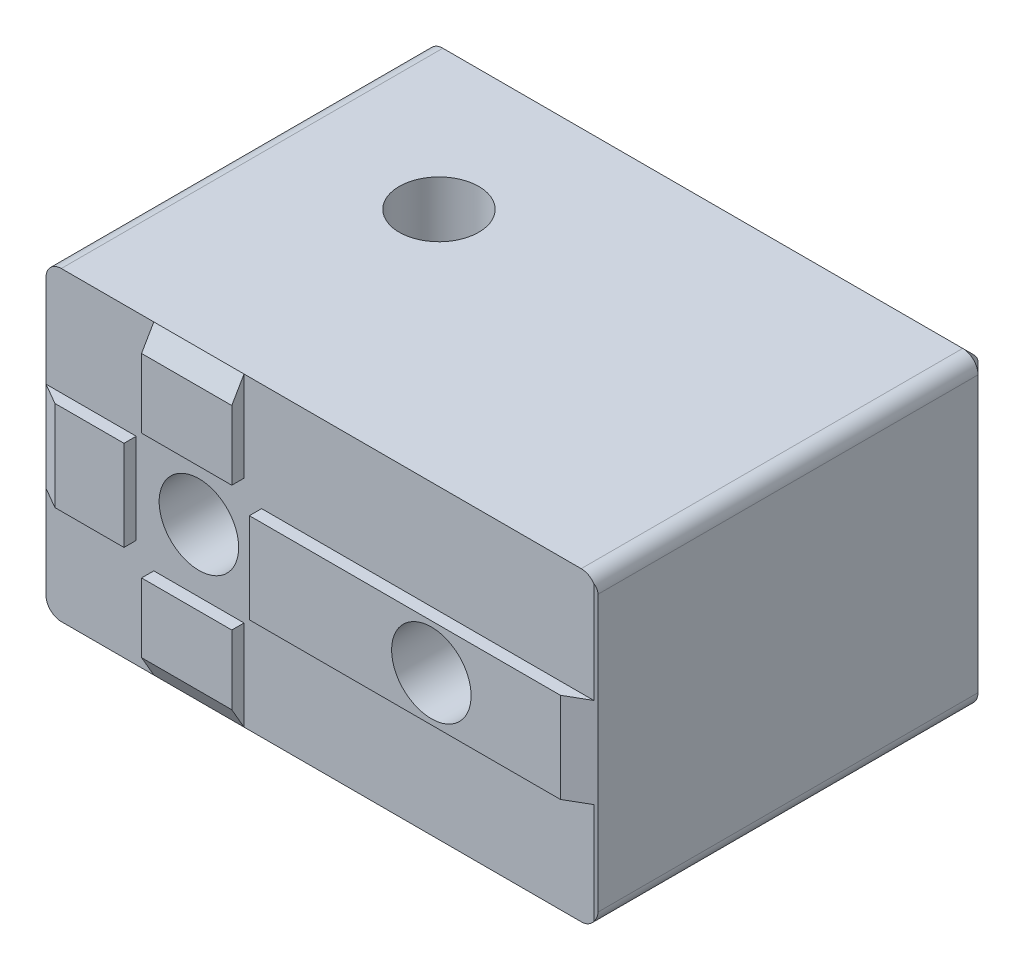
ISO-10303-21;
HEADER;
FILE_DESCRIPTION(('STEP AP214'),'2;1');
FILE_NAME('part.step','',(''),(''),'','','');
FILE_SCHEMA(('AUTOMOTIVE_DESIGN { 1 0 10303 214 1 1 1 1 }'));
ENDSEC;
DATA;
#1=APPLICATION_CONTEXT('core data for automotive mechanical design processes');
#2=APPLICATION_PROTOCOL_DEFINITION('international standard','automotive_design',2000,#1);
#3=PRODUCT_CONTEXT('',#1,'mechanical');
#4=PRODUCT('Part','Part','',(#3));
#5=PRODUCT_RELATED_PRODUCT_CATEGORY('part','',(#4));
#6=PRODUCT_DEFINITION_FORMATION('','',#4);
#7=PRODUCT_DEFINITION_CONTEXT('part definition',#1,'design');
#8=PRODUCT_DEFINITION('design','',#6,#7);
#9=PRODUCT_DEFINITION_SHAPE('','',#8);
#10=(LENGTH_UNIT() NAMED_UNIT(*) SI_UNIT(.MILLI.,.METRE.));
#11=(NAMED_UNIT(*) PLANE_ANGLE_UNIT() SI_UNIT($,.RADIAN.));
#12=(NAMED_UNIT(*) SI_UNIT($,.STERADIAN.) SOLID_ANGLE_UNIT());
#13=UNCERTAINTY_MEASURE_WITH_UNIT(LENGTH_MEASURE(1.E-05),#10,'distance_accuracy_value','');
#14=(GEOMETRIC_REPRESENTATION_CONTEXT(3) GLOBAL_UNCERTAINTY_ASSIGNED_CONTEXT((#13)) GLOBAL_UNIT_ASSIGNED_CONTEXT((#10,
#11,#12)) REPRESENTATION_CONTEXT('',''));
#15=CARTESIAN_POINT('',(0.,0.,0.));
#16=DIRECTION('',(0.,0.,1.));
#17=DIRECTION('',(1.,0.,0.));
#18=AXIS2_PLACEMENT_3D('',#15,#16,#17);
#19=CARTESIAN_POINT('',(-8.32667268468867E-13,4.5,10.));
#20=DIRECTION('',(0.,-1.,0.));
#21=DIRECTION('',(0.,0.,-1.00000000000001));
#22=AXIS2_PLACEMENT_3D('',#19,#20,#21);
#23=PLANE('',#22);
#24=DIRECTION('',(0.,0.,-1.00000000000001));
#25=VECTOR('',#24,1.);
#26=CARTESIAN_POINT('',(-2.17944947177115,4.50000000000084,36.142135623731));
#27=LINE('',#26,#25);
#28=CARTESIAN_POINT('',(-2.17944947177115,4.50000000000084,16.1237243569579));
#29=VERTEX_POINT('',#28);
#30=CARTESIAN_POINT('',(-2.17944947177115,4.50000000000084,11.4177446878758));
#31=VERTEX_POINT('',#30);
#32=EDGE_CURVE('E272',#29,#31,#27,.T.);
#33=ORIENTED_EDGE('',*,*,#32,.F.);
#34=CARTESIAN_POINT('',(-8.32667268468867E-13,4.5,10.));
#35=DIRECTION('',(0.,-1.,0.));
#36=DIRECTION('',(0.,0.,-1.00000000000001));
#37=AXIS2_PLACEMENT_3D('',#34,#35,#36);
#38=CIRCLE('',#37,6.5);
#39=CARTESIAN_POINT('',(-2.17944947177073,4.50000000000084,3.87627564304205));
#40=VERTEX_POINT('',#39);
#41=EDGE_CURVE('E315',#29,#40,#38,.T.);
#42=ORIENTED_EDGE('',*,*,#41,.T.);
#43=CARTESIAN_POINT('',(-2.17944947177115,4.50000000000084,8.58225531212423));
#44=VERTEX_POINT('',#43);
#45=EDGE_CURVE('E441',#44,#40,#27,.T.);
#46=ORIENTED_EDGE('',*,*,#45,.F.);
#47=CARTESIAN_POINT('',(-8.32667268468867E-13,4.5,10.));
#48=DIRECTION('',(0.,-1.,0.));
#49=DIRECTION('',(0.,0.,-1.00000000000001));
#50=AXIS2_PLACEMENT_3D('',#47,#48,#49);
#51=CIRCLE('',#50,2.6);
#52=EDGE_CURVE('E293',#44,#31,#51,.F.);
#53=ORIENTED_EDGE('',*,*,#52,.T.);
#54=EDGE_LOOP('',(#33,#42,#46,#53));
#55=FACE_BOUND('',#54,.T.);
#56=ADVANCED_FACE('F48',(#55),#23,.T.);
#57=CARTESIAN_POINT('',(16.,0.,51.9488094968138));
#58=DIRECTION('',(0.,0.,-1.00000000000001));
#59=DIRECTION('',(-1.00000000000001,0.,0.));
#60=AXIS2_PLACEMENT_3D('',#57,#58,#59);
#61=CYLINDRICAL_SURFACE('',#60,2.6);
#62=CARTESIAN_POINT('',(15.9999999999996,0.,26.5));
#63=DIRECTION('',(0.,0.,-1.00000000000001));
#64=DIRECTION('',(-1.00000000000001,0.,0.));
#65=AXIS2_PLACEMENT_3D('',#62,#63,#64);
#66=CIRCLE('',#65,2.6);
#67=CARTESIAN_POINT('',(13.3999999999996,0.,26.5));
#68=VERTEX_POINT('',#67);
#69=EDGE_CURVE('E316',#68,#68,#66,.T.);
#70=ORIENTED_EDGE('',*,*,#69,.F.);
#71=EDGE_LOOP('',(#70));
#72=FACE_BOUND('',#71,.T.);
#73=CARTESIAN_POINT('',(15.9999999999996,0.,5.));
#74=DIRECTION('',(0.,0.,-1.00000000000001));
#75=DIRECTION('',(-1.00000000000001,0.,0.));
#76=AXIS2_PLACEMENT_3D('',#73,#74,#75);
#77=CIRCLE('',#76,2.6);
#78=CARTESIAN_POINT('',(13.3999999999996,0.,5.));
#79=VERTEX_POINT('',#78);
#80=EDGE_CURVE('E327',#79,#79,#77,.F.);
#81=ORIENTED_EDGE('',*,*,#80,.F.);
#82=EDGE_LOOP('',(#81));
#83=FACE_BOUND('',#82,.T.);
#84=ADVANCED_FACE('F463',(#72,#83),#61,.F.);
#85=CARTESIAN_POINT('',(15.9999999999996,0.,5.));
#86=DIRECTION('',(0.,0.,-1.00000000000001));
#87=DIRECTION('',(-1.00000000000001,0.,0.));
#88=AXIS2_PLACEMENT_3D('',#85,#86,#87);
#89=PLANE('',#88);
#90=ORIENTED_EDGE('',*,*,#80,.T.);
#91=EDGE_LOOP('',(#90));
#92=FACE_BOUND('',#91,.T.);
#93=CARTESIAN_POINT('',(15.9999999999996,0.,5.));
#94=DIRECTION('',(0.,0.,-1.00000000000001));
#95=DIRECTION('',(-1.00000000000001,0.,0.));
#96=AXIS2_PLACEMENT_3D('',#93,#94,#95);
#97=CIRCLE('',#96,5.);
#98=CARTESIAN_POINT('',(10.9999999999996,0.,5.));
#99=VERTEX_POINT('',#98);
#100=EDGE_CURVE('E330',#99,#99,#97,.F.);
#101=ORIENTED_EDGE('',*,*,#100,.F.);
#102=EDGE_LOOP('',(#101));
#103=FACE_BOUND('',#102,.T.);
#104=ADVANCED_FACE('F459',(#92,#103),#89,.T.);
#105=CARTESIAN_POINT('',(-4.16333634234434E-13,0.,22.));
#106=DIRECTION('',(0.,0.,-1.00000000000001));
#107=DIRECTION('',(-1.00000000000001,0.,0.));
#108=AXIS2_PLACEMENT_3D('',#105,#106,#107);
#109=PLANE('',#108);
#110=CARTESIAN_POINT('',(-4.16333634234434E-13,0.,22.));
#111=DIRECTION('',(0.,0.,1.00000000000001));
#112=DIRECTION('',(1.00000000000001,0.,0.));
#113=AXIS2_PLACEMENT_3D('',#110,#111,#112);
#114=CIRCLE('',#113,2.6);
#115=CARTESIAN_POINT('',(2.5999999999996,0.,22.));
#116=VERTEX_POINT('',#115);
#117=EDGE_CURVE('E309',#116,#116,#114,.T.);
#118=ORIENTED_EDGE('',*,*,#117,.T.);
#119=EDGE_LOOP('',(#118));
#120=FACE_BOUND('',#119,.T.);
#121=CARTESIAN_POINT('',(-4.16333634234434E-13,0.,22.));
#122=DIRECTION('',(0.,0.,-1.00000000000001));
#123=DIRECTION('',(-1.00000000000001,0.,0.));
#124=AXIS2_PLACEMENT_3D('',#121,#122,#123);
#125=CIRCLE('',#124,5.);
#126=CARTESIAN_POINT('',(-5.00000000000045,0.,22.));
#127=VERTEX_POINT('',#126);
#128=EDGE_CURVE('E277',#127,#127,#125,.F.);
#129=ORIENTED_EDGE('',*,*,#128,.F.);
#130=EDGE_LOOP('',(#129));
#131=FACE_BOUND('',#130,.T.);
#132=ADVANCED_FACE('F455',(#120,#131),#109,.T.);
#133=CARTESIAN_POINT('',(-4.16333634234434E-13,0.,26.5));
#134=DIRECTION('',(0.,0.,1.00000000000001));
#135=DIRECTION('',(1.00000000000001,0.,0.));
#136=AXIS2_PLACEMENT_3D('',#133,#134,#135);
#137=PLANE('',#136);
#138=DIRECTION('',(0.,-1.,0.));
#139=VECTOR('',#138,1.);
#140=CARTESIAN_POINT('',(2.94999999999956,-9.99999999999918,26.5));
#141=LINE('',#140,#139);
#142=CARTESIAN_POINT('',(2.94999999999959,-8.61435935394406,26.5));
#143=VERTEX_POINT('',#142);
#144=CARTESIAN_POINT('',(2.94999999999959,-4.09999999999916,26.5));
#145=VERTEX_POINT('',#144);
#146=EDGE_CURVE('E605',#143,#145,#141,.F.);
#147=ORIENTED_EDGE('',*,*,#146,.T.);
#148=DIRECTION('',(1.00000000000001,0.,0.));
#149=VECTOR('',#148,1.);
#150=CARTESIAN_POINT('',(2.94999999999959,-4.09999999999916,26.5));
#151=LINE('',#150,#149);
#152=CARTESIAN_POINT('',(-2.9500000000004,-4.09999999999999,26.5));
#153=VERTEX_POINT('',#152);
#154=EDGE_CURVE('E602',#145,#153,#151,.F.);
#155=ORIENTED_EDGE('',*,*,#154,.T.);
#156=DIRECTION('',(0.,1.,0.));
#157=VECTOR('',#156,1.);
#158=CARTESIAN_POINT('',(-2.95000000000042,-10.,26.5));
#159=LINE('',#158,#157);
#160=CARTESIAN_POINT('',(-2.95000000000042,-8.61435935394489,26.5));
#161=VERTEX_POINT('',#160);
#162=EDGE_CURVE('E598',#153,#161,#159,.F.);
#163=ORIENTED_EDGE('',*,*,#162,.T.);
#164=DIRECTION('',(1.00000000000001,0.,0.));
#165=VECTOR('',#164,1.);
#166=CARTESIAN_POINT('',(-4.16333634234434E-13,-8.61435935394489,26.5));
#167=LINE('',#166,#165);
#168=EDGE_CURVE('E326',#143,#161,#167,.F.);
#169=ORIENTED_EDGE('',*,*,#168,.F.);
#170=EDGE_LOOP('',(#147,#155,#163,#169));
#171=FACE_BOUND('',#170,.T.);
#172=ADVANCED_FACE('F449',(#171),#137,.T.);
#173=CARTESIAN_POINT('',(-8.32667268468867E-13,4.5,10.));
#174=DIRECTION('',(0.,-1.,0.));
#175=DIRECTION('',(0.,0.,-1.00000000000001));
#176=AXIS2_PLACEMENT_3D('',#173,#174,#175);
#177=CYLINDRICAL_SURFACE('',#176,6.5);
#178=CARTESIAN_POINT('',(-4.16333634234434E-13,-10.,10.));
#179=DIRECTION('',(0.,-1.,0.));
#180=DIRECTION('',(0.,0.,-1.00000000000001));
#181=AXIS2_PLACEMENT_3D('',#178,#179,#180);
#182=CIRCLE('',#181,6.5);
#183=CARTESIAN_POINT('',(-4.16270208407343E-13,-10.,3.49999999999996));
#184=VERTEX_POINT('',#183);
#185=EDGE_CURVE('E304',#184,#184,#182,.T.);
#186=ORIENTED_EDGE('',*,*,#185,.T.);
#187=EDGE_LOOP('',(#186));
#188=FACE_BOUND('',#187,.T.);
#189=ORIENTED_EDGE('',*,*,#41,.F.);
#190=CARTESIAN_POINT('',(-2.17944947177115,4.50000000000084,16.1237243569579));
#191=CARTESIAN_POINT('',(-2.31476751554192,4.43445974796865,16.0755817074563));
#192=CARTESIAN_POINT('',(-2.44599225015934,4.3633737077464,16.0238097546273));
#193=CARTESIAN_POINT('',(-2.69967839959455,4.21112765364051,15.9144511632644));
#194=CARTESIAN_POINT('',(-2.82214986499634,4.12997949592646,15.8568713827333));
#195=CARTESIAN_POINT('',(-3.05790483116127,3.95859001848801,15.7373063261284));
#196=CARTESIAN_POINT('',(-3.17120100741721,3.86836164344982,15.6753273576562));
#197=CARTESIAN_POINT('',(-3.3886249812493,3.67939848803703,15.5482497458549));
#198=CARTESIAN_POINT('',(-3.49275003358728,3.58066117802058,15.4831501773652));
#199=CARTESIAN_POINT('',(-3.69119753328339,3.3756954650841,15.3515578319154));
#200=CARTESIAN_POINT('',(-3.78556208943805,3.26950287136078,15.2850726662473));
#201=CARTESIAN_POINT('',(-3.96488390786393,3.04956247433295,15.1519090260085));
#202=CARTESIAN_POINT('',(-4.04984090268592,2.93581445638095,15.0852305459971));
#203=CARTESIAN_POINT('',(-4.21017733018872,2.70085998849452,14.9533001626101));
#204=CARTESIAN_POINT('',(-4.2855522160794,2.57965003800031,14.8880489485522));
#205=CARTESIAN_POINT('',(-4.42629203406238,2.32990898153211,14.7609805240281));
#206=CARTESIAN_POINT('',(-4.4916601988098,2.2013802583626,14.6991622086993));
#207=CARTESIAN_POINT('',(-4.63701068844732,1.88164127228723,14.5565694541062));
#208=CARTESIAN_POINT('',(-4.71170229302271,1.68666265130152,14.478654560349));
#209=CARTESIAN_POINT('',(-4.83723710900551,1.28280823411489,14.3427827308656));
#210=CARTESIAN_POINT('',(-4.88814324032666,1.07397079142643,14.2847732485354));
#211=CARTESIAN_POINT('',(-4.95678001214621,0.680674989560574,14.2050769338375));
#212=CARTESIAN_POINT('',(-4.97858952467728,0.497854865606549,14.1789857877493));
#213=CARTESIAN_POINT('',(-5.00173652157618,0.129115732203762,14.1512658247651));
#214=CARTESIAN_POINT('',(-5.00309081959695,-0.0568006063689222,14.1496169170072));
#215=CARTESIAN_POINT('',(-4.98525477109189,-0.425850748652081,14.1710172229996));
#216=CARTESIAN_POINT('',(-4.96609487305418,-0.60898826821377,14.1940298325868));
#217=CARTESIAN_POINT('',(-4.9087195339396,-0.968364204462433,14.2610302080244));
#218=CARTESIAN_POINT('',(-4.87047221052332,-1.14459054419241,14.3050530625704));
#219=CARTESIAN_POINT('',(-4.75474800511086,-1.56875186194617,14.4331460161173));
#220=CARTESIAN_POINT('',(-4.66727355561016,-1.81120843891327,14.5263097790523));
#221=CARTESIAN_POINT('',(-4.51217304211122,-2.1578722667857,14.6792789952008));
#222=CARTESIAN_POINT('',(-4.45638948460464,-2.27074683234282,14.7325627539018));
#223=CARTESIAN_POINT('',(-4.33716822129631,-2.49090654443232,14.8420569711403));
#224=CARTESIAN_POINT('',(-4.27373150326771,-2.59819240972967,14.8982670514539));
#225=CARTESIAN_POINT('',(-4.06678584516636,-2.92031657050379,15.073932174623));
#226=CARTESIAN_POINT('',(-3.91090422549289,-3.12592755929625,15.1960132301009));
#227=CARTESIAN_POINT('',(-3.56854215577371,-3.51168360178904,15.4368547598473));
#228=CARTESIAN_POINT('',(-3.38208409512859,-3.69184711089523,15.5556175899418));
#229=CARTESIAN_POINT('',(-2.98285359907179,-4.0209729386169,15.7796189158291));
#230=CARTESIAN_POINT('',(-2.7706202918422,-4.17044228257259,15.8850637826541));
#231=CARTESIAN_POINT('',(-2.31914898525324,-4.43735935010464,16.077137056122));
#232=CARTESIAN_POINT('',(-2.07993626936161,-4.55483670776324,16.1637828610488));
#233=CARTESIAN_POINT('',(-1.61793514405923,-4.73642662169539,16.2992610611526));
#234=CARTESIAN_POINT('',(-1.39845602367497,-4.80601937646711,16.3518928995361));
#235=CARTESIAN_POINT('',(-1.06079637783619,-4.88755367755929,16.4138822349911));
#236=CARTESIAN_POINT('',(-0.946809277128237,-4.91092537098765,16.431721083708));
#237=CARTESIAN_POINT('',(-0.716739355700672,-4.94973413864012,16.4614013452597));
#238=CARTESIAN_POINT('',(-0.600657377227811,-4.96517433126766,16.473245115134));
#239=CARTESIAN_POINT('',(-0.366803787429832,-4.98791660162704,16.4907056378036));
#240=CARTESIAN_POINT('',(-0.249027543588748,-4.99518865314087,16.496299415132));
#241=CARTESIAN_POINT('',(-0.0131683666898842,-5.0013734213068,16.5010562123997));
#242=CARTESIAN_POINT('',(0.104914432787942,-5.00028931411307,16.5002216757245));
#243=CARTESIAN_POINT('',(0.340518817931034,-4.98978522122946,16.4921448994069));
#244=CARTESIAN_POINT('',(0.458040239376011,-4.98036293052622,16.4849008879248));
#245=CARTESIAN_POINT('',(0.691574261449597,-4.95333660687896,16.4641680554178));
#246=CARTESIAN_POINT('',(0.807586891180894,-4.9357327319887,16.4506793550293));
#247=CARTESIAN_POINT('',(1.03154473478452,-4.89369394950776,16.4185719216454));
#248=CARTESIAN_POINT('',(1.13960391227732,-4.86964307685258,16.4002422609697));
#249=CARTESIAN_POINT('',(1.35299724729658,-4.8147226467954,16.3585562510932));
#250=CARTESIAN_POINT('',(1.45833051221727,-4.78385088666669,16.3351982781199));
#251=CARTESIAN_POINT('',(1.76935428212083,-4.68155296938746,16.2581866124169));
#252=CARTESIAN_POINT('',(1.97022699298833,-4.60041380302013,16.1975716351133));
#253=CARTESIAN_POINT('',(2.3745917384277,-4.40641738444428,16.054896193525));
#254=CARTESIAN_POINT('',(2.57640771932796,-4.29122948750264,15.9713152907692));
#255=CARTESIAN_POINT('',(2.95845378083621,-4.03735432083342,15.791563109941));
#256=CARTESIAN_POINT('',(3.13866912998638,-3.89865116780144,15.6953833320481));
#257=CARTESIAN_POINT('',(3.51027754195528,-3.5708561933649,15.4756952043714));
#258=CARTESIAN_POINT('',(3.69674071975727,-3.37723121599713,15.3505604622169));
#259=CARTESIAN_POINT('',(3.9512820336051,-3.06680573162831,15.1622278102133));
#260=CARTESIAN_POINT('',(4.03199357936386,-2.95990189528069,15.0992925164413));
#261=CARTESIAN_POINT('',(4.18487905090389,-2.7394844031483,14.9745848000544));
#262=CARTESIAN_POINT('',(4.25705430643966,-2.62597178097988,14.9128121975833));
#263=CARTESIAN_POINT('',(4.38301213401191,-2.40886853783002,14.80055050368));
#264=CARTESIAN_POINT('',(4.43795295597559,-2.30613792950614,14.7496991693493));
#265=CARTESIAN_POINT('',(4.54105582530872,-2.09583904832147,14.6512263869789));
#266=CARTESIAN_POINT('',(4.589216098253,-1.98826951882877,14.603605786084));
#267=CARTESIAN_POINT('',(4.72278709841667,-1.6587163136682,14.4678059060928));
#268=CARTESIAN_POINT('',(4.79763890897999,-1.42929057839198,14.3863638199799));
#269=CARTESIAN_POINT('',(4.89994223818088,-1.01215830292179,14.271424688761));
#270=CARTESIAN_POINT('',(4.93453750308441,-0.828161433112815,14.2310520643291));
#271=CARTESIAN_POINT('',(4.97081924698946,-0.547608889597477,14.1882305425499));
#272=CARTESIAN_POINT('',(4.98031080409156,-0.453360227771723,14.1769136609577));
#273=CARTESIAN_POINT('',(4.99392957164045,-0.263946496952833,14.1606236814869));
#274=CARTESIAN_POINT('',(4.99805875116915,-0.168781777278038,14.1556482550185));
#275=CARTESIAN_POINT('',(5.0008647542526,0.0220547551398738,14.1522713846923));
#276=CARTESIAN_POINT('',(4.99952392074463,0.117727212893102,14.1538912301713));
#277=CARTESIAN_POINT('',(4.99138916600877,0.308483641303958,14.1636598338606));
#278=CARTESIAN_POINT('',(4.98459537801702,0.403567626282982,14.171808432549));
#279=CARTESIAN_POINT('',(4.9562036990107,0.687053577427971,14.2055902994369));
#280=CARTESIAN_POINT('',(4.92659450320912,0.873610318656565,14.2405606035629));
#281=CARTESIAN_POINT('',(4.83586753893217,1.29381382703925,14.3439946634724));
#282=CARTESIAN_POINT('',(4.76783706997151,1.52417982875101,14.4194721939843));
#283=CARTESIAN_POINT('',(4.64440386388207,1.85567338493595,14.5478658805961));
#284=CARTESIAN_POINT('',(4.59958006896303,1.96403776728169,14.5933029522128));
#285=CARTESIAN_POINT('',(4.50315486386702,2.17603671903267,14.6878724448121));
#286=CARTESIAN_POINT('',(4.45155502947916,2.27967238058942,14.7370040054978));
#287=CARTESIAN_POINT('',(4.3229274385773,2.51720693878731,14.855134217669));
#288=CARTESIAN_POINT('',(4.24327459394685,2.64918764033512,14.9251310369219));
#289=CARTESIAN_POINT('',(4.07271044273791,2.90458521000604,15.067085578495));
#290=CARTESIAN_POINT('',(3.98179507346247,3.02799896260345,15.1390440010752));
#291=CARTESIAN_POINT('',(3.78919185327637,3.2657886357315,15.2826527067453));
#292=CARTESIAN_POINT('',(3.68752755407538,3.38018339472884,15.3543033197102));
#293=CARTESIAN_POINT('',(3.47351581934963,3.59974911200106,15.4955564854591));
#294=CARTESIAN_POINT('',(3.36117232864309,3.70492344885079,15.5651597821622));
#295=CARTESIAN_POINT('',(3.08491124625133,3.9403937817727,15.72422479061));
#296=CARTESIAN_POINT('',(2.91664295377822,4.06670983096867,15.8121767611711));
#297=CARTESIAN_POINT('',(2.65046097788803,4.241030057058,15.9358801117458));
#298=CARTESIAN_POINT('',(2.55935765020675,4.29665006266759,15.9757727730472));
#299=CARTESIAN_POINT('',(2.37269907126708,4.40247727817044,16.0523117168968));
#300=CARTESIAN_POINT('',(2.27714201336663,4.45268226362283,16.0889566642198));
#301=CARTESIAN_POINT('',(2.17944947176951,4.5,16.1237243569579));
#302=B_SPLINE_CURVE_WITH_KNOTS('',3,(#190,#191,#192,#193,#194,#195,#196,#197,#198,#199,#200,
#201,#202,#203,#204,#205,#206,#207,#208,#209,#210,#211,#212,#213,#214,#215,#216,#217,#218,#219,
#220,#221,#222,#223,#224,#225,#226,#227,#228,#229,#230,#231,#232,#233,#234,#235,#236,#237,#238,
#239,#240,#241,#242,#243,#244,#245,#246,#247,#248,#249,#250,#251,#252,#253,#254,#255,#256,#257,
#258,#259,#260,#261,#262,#263,#264,#265,#266,#267,#268,#269,#270,#271,#272,#273,#274,#275,#276,
#277,#278,#279,#280,#281,#282,#283,#284,#285,#286,#287,#288,#289,#290,#291,#292,#293,#294,#295,
#296,#297,#298,#299,#300,#301),.UNSPECIFIED.,.F.,.F.,(4,2,2,2,2,2,2,2,2,2,2,2,2,2,2,2,2,2,2,2,2,
2,2,2,2,2,2,2,2,2,2,2,2,2,2,2,2,2,2,2,2,2,2,2,2,2,2,2,2,2,2,2,2,2,2,4),(0.,0.473287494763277,
0.946022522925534,1.41809292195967,1.89030415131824,2.36038480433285,2.83047881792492,
3.30079506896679,3.77095906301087,4.43739361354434,5.10205511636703,5.65741878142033,
6.21232592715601,6.76641058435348,7.32142386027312,8.13878096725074,8.54869369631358,
8.95855357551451,9.81187164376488,10.6645676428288,11.5017846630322,12.3382235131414,
13.0434619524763,13.3962427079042,13.7488846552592,14.1028187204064,14.4566182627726,
14.8105156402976,15.164406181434,15.5006650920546,15.8370327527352,16.5092849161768,
17.2474829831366,17.9861816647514,18.8720952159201,19.3157913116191,19.7594181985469,
20.140448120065,20.5215775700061,21.2815613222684,21.8536458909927,22.139520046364,
22.4252891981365,22.7119815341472,22.9986668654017,23.5722718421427,24.3232800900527,
24.7003444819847,25.0773213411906,25.5845722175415,26.0920066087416,26.598351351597,
27.1045097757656,27.7866559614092,28.1282830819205,28.4700500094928),.UNSPECIFIED.);
#303=CARTESIAN_POINT('',(2.17944947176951,4.5,16.1237243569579));
#304=VERTEX_POINT('',#303);
#305=EDGE_CURVE('E423',#29,#304,#302,.T.);
#306=ORIENTED_EDGE('',*,*,#305,.T.);
#307=CARTESIAN_POINT('',(2.17944947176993,4.5,3.87627564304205));
#308=VERTEX_POINT('',#307);
#309=EDGE_CURVE('E286',#308,#304,#38,.T.);
#310=ORIENTED_EDGE('',*,*,#309,.F.);
#311=CARTESIAN_POINT('',(2.17944947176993,4.5,3.87627564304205));
#312=CARTESIAN_POINT('',(2.31476751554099,4.43445974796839,3.92441829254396));
#313=CARTESIAN_POINT('',(2.44599225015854,4.36337370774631,3.97619024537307));
#314=CARTESIAN_POINT('',(2.69967839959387,4.21112765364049,4.08554883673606));
#315=CARTESIAN_POINT('',(2.82214986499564,4.12997949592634,4.14312861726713));
#316=CARTESIAN_POINT('',(3.05790483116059,3.95859001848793,4.26269367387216));
#317=CARTESIAN_POINT('',(3.17120100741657,3.86836164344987,4.32467264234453));
#318=CARTESIAN_POINT('',(3.38862498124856,3.67939848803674,4.45175025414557));
#319=CARTESIAN_POINT('',(3.49275003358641,3.58066117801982,4.51684982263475));
#320=CARTESIAN_POINT('',(3.69119753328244,3.3756954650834,4.64844216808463));
#321=CARTESIAN_POINT('',(3.78556208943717,3.26950287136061,4.71492733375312));
#322=CARTESIAN_POINT('',(3.96488390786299,3.0495624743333,4.84809097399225));
#323=CARTESIAN_POINT('',(4.04984090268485,2.93581445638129,4.91476945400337));
#324=CARTESIAN_POINT('',(4.21017733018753,2.70085998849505,5.04669983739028));
#325=CARTESIAN_POINT('',(4.28555221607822,2.57965003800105,5.11195105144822));
#326=CARTESIAN_POINT('',(4.426292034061,2.32990898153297,5.23901947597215));
#327=CARTESIAN_POINT('',(4.4916601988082,2.20138025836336,5.30083779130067));
#328=CARTESIAN_POINT('',(4.63701068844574,1.88164127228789,5.44343054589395));
#329=CARTESIAN_POINT('',(4.71170229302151,1.68666265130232,5.5213454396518));
#330=CARTESIAN_POINT('',(4.83723710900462,1.28280823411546,5.65721726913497));
#331=CARTESIAN_POINT('',(4.88814324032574,1.07397079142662,5.71522675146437));
#332=CARTESIAN_POINT('',(4.95678001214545,0.680674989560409,5.79492306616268));
#333=CARTESIAN_POINT('',(4.97858952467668,0.497854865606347,5.82101421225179));
#334=CARTESIAN_POINT('',(5.00173652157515,0.129115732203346,5.84873417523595));
#335=CARTESIAN_POINT('',(5.00309081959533,-0.0568006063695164,5.85038308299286));
#336=CARTESIAN_POINT('',(4.98525477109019,-0.425850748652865,5.82898277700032));
#337=CARTESIAN_POINT('',(4.96609487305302,-0.608988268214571,5.80597016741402));
#338=CARTESIAN_POINT('',(4.90871953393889,-0.968364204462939,5.73896979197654));
#339=CARTESIAN_POINT('',(4.87047221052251,-1.1445905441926,5.69494693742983));
#340=CARTESIAN_POINT('',(4.75474800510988,-1.56875186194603,5.56685398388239));
#341=CARTESIAN_POINT('',(4.66727355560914,-1.81120843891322,5.4736902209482));
#342=CARTESIAN_POINT('',(4.51217304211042,-2.15787226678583,5.32072100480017));
#343=CARTESIAN_POINT('',(4.45638948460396,-2.27074683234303,5.26743724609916));
#344=CARTESIAN_POINT('',(4.3371682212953,-2.49090654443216,5.15794302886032));
#345=CARTESIAN_POINT('',(4.27373150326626,-2.59819240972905,5.10173294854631));
#346=CARTESIAN_POINT('',(4.06678584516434,-2.92031657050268,4.92606782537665));
#347=CARTESIAN_POINT('',(3.9109042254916,-3.12592755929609,4.80398676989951));
#348=CARTESIAN_POINT('',(3.56854215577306,-3.51168360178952,4.56314524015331));
#349=CARTESIAN_POINT('',(3.38208409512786,-3.6918471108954,4.44438241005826));
#350=CARTESIAN_POINT('',(2.98285359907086,-4.02097293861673,4.2203810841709));
#351=CARTESIAN_POINT('',(2.77062029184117,-4.17044228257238,4.11493621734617));
#352=CARTESIAN_POINT('',(2.31914898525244,-4.43735935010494,3.92286294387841));
#353=CARTESIAN_POINT('',(2.07993626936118,-4.55483670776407,3.83621713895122));
#354=CARTESIAN_POINT('',(1.61793514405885,-4.73642662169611,3.70073893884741));
#355=CARTESIAN_POINT('',(1.39845602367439,-4.80601937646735,3.64810710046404));
#356=CARTESIAN_POINT('',(1.06079637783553,-4.8875536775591,3.58611776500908));
#357=CARTESIAN_POINT('',(0.946809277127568,-4.91092537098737,3.56827891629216));
#358=CARTESIAN_POINT('',(0.716739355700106,-4.94973413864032,3.53859865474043));
#359=CARTESIAN_POINT('',(0.600657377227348,-4.96517433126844,3.526754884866));
#360=CARTESIAN_POINT('',(0.366803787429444,-4.98791660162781,3.50929436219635));
#361=CARTESIAN_POINT('',(0.249027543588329,-4.99518865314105,3.50370058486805));
#362=CARTESIAN_POINT('',(0.0131683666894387,-5.0013734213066,3.49894378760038));
#363=CARTESIAN_POINT('',(-0.104914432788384,-5.00028931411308,3.49977832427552));
#364=CARTESIAN_POINT('',(-0.340518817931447,-4.98978522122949,3.50785510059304));
#365=CARTESIAN_POINT('',(-0.458040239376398,-4.98036293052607,3.51509911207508));
#366=CARTESIAN_POINT('',(-0.691574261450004,-4.95333660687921,3.53583194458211));
#367=CARTESIAN_POINT('',(-0.80758689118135,-4.93573273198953,3.5493206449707));
#368=CARTESIAN_POINT('',(-1.03154473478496,-4.89369394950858,3.58142807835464));
#369=CARTESIAN_POINT('',(-1.1396039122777,-4.86964307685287,3.59975773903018));
#370=CARTESIAN_POINT('',(-1.35299724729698,-4.81472264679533,3.64144374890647));
#371=CARTESIAN_POINT('',(-1.45833051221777,-4.7838508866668,3.66480172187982));
#372=CARTESIAN_POINT('',(-1.76935428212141,-4.68155296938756,3.74181338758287));
#373=CARTESIAN_POINT('',(-1.97022699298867,-4.60041380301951,3.80242836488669));
#374=CARTESIAN_POINT('',(-2.37459173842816,-4.40641738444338,3.94510380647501));
#375=CARTESIAN_POINT('',(-2.57640771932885,-4.29122948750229,4.02868470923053));
#376=CARTESIAN_POINT('',(-2.95845378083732,-4.03735432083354,4.20843689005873));
#377=CARTESIAN_POINT('',(-3.13866912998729,-3.89865116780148,4.30461666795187));
#378=CARTESIAN_POINT('',(-3.51027754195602,-3.57085619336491,4.52430479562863));
#379=CARTESIAN_POINT('',(-3.6967407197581,-3.37723121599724,4.64943953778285));
#380=CARTESIAN_POINT('',(-3.95128203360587,-3.06680573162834,4.83777218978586));
#381=CARTESIAN_POINT('',(-4.03199357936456,-2.95990189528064,4.9007074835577));
#382=CARTESIAN_POINT('',(-4.18487905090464,-2.73948440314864,5.02541519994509));
#383=CARTESIAN_POINT('',(-4.25705430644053,-2.62597178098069,5.08718780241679));
#384=CARTESIAN_POINT('',(-4.38301213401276,-2.40886853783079,5.19944949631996));
#385=CARTESIAN_POINT('',(-4.43795295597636,-2.30613792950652,5.25030083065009));
#386=CARTESIAN_POINT('',(-4.54105582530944,-2.09583904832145,5.34877361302));
#387=CARTESIAN_POINT('',(-4.58921609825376,-1.98826951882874,5.39639421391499));
#388=CARTESIAN_POINT('',(-4.72278709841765,-1.65871631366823,5.53219409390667));
#389=CARTESIAN_POINT('',(-4.79763890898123,-1.42929057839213,5.61363618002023));
#390=CARTESIAN_POINT('',(-4.89994223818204,-1.01215830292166,5.72857531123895));
#391=CARTESIAN_POINT('',(-4.93453750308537,-0.828161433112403,5.76894793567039));
#392=CARTESIAN_POINT('',(-4.97081924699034,-0.547608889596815,5.81176945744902));
#393=CARTESIAN_POINT('',(-4.98031080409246,-0.453360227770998,5.82308633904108));
#394=CARTESIAN_POINT('',(-4.99392957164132,-0.263946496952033,5.83937631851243));
#395=CARTESIAN_POINT('',(-4.99805875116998,-0.168781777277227,5.84435174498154));
#396=CARTESIAN_POINT('',(-5.00086475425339,0.0220547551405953,5.84772861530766));
#397=CARTESIAN_POINT('',(-4.99952392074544,0.117727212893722,5.84610876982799));
#398=CARTESIAN_POINT('',(-4.99138916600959,0.308483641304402,5.83634016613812));
#399=CARTESIAN_POINT('',(-4.98459537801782,0.403567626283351,5.82819156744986));
#400=CARTESIAN_POINT('',(-4.95620369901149,0.687053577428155,5.79440970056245));
#401=CARTESIAN_POINT('',(-4.92659450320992,0.873610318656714,5.75943939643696));
#402=CARTESIAN_POINT('',(-4.83586753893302,1.29381382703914,5.65600533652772));
#403=CARTESIAN_POINT('',(-4.7678370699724,1.52417982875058,5.5805278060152));
#404=CARTESIAN_POINT('',(-4.64440386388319,1.85567338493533,5.4521341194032));
#405=CARTESIAN_POINT('',(-4.59958006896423,1.96403776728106,5.40669704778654));
#406=CARTESIAN_POINT('',(-4.50315486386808,2.17603671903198,5.3121275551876));
#407=CARTESIAN_POINT('',(-4.45155502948,2.27967238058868,5.26299599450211));
#408=CARTESIAN_POINT('',(-4.32292743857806,2.51720693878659,5.14486578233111));
#409=CARTESIAN_POINT('',(-4.24327459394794,2.64918764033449,5.07486896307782));
#410=CARTESIAN_POINT('',(-4.07271044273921,2.90458521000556,4.93291442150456));
#411=CARTESIAN_POINT('',(-3.98179507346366,3.02799896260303,4.86095599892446));
#412=CARTESIAN_POINT('',(-3.78919185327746,3.26578863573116,4.71734729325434));
#413=CARTESIAN_POINT('',(-3.6875275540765,3.38018339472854,4.64569668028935));
#414=CARTESIAN_POINT('',(-3.47351581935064,3.5997491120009,4.50444351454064));
#415=CARTESIAN_POINT('',(-3.36117232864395,3.70492344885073,4.43484021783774));
#416=CARTESIAN_POINT('',(-3.0849112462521,3.94039378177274,4.27577520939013));
#417=CARTESIAN_POINT('',(-2.91664295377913,4.06670983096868,4.18782323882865));
#418=CARTESIAN_POINT('',(-2.65046097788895,4.24103005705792,4.06411988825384));
#419=CARTESIAN_POINT('',(-2.55935765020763,4.29665006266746,4.02422722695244));
#420=CARTESIAN_POINT('',(-2.37269907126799,4.4024772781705,3.94768828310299));
#421=CARTESIAN_POINT('',(-2.27714201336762,4.45268226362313,3.91104333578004));
#422=CARTESIAN_POINT('',(-2.17944947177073,4.50000000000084,3.87627564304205));
#423=B_SPLINE_CURVE_WITH_KNOTS('',3,(#311,#312,#313,#314,#315,#316,#317,#318,#319,#320,#321,
#322,#323,#324,#325,#326,#327,#328,#329,#330,#331,#332,#333,#334,#335,#336,#337,#338,#339,#340,
#341,#342,#343,#344,#345,#346,#347,#348,#349,#350,#351,#352,#353,#354,#355,#356,#357,#358,#359,
#360,#361,#362,#363,#364,#365,#366,#367,#368,#369,#370,#371,#372,#373,#374,#375,#376,#377,#378,
#379,#380,#381,#382,#383,#384,#385,#386,#387,#388,#389,#390,#391,#392,#393,#394,#395,#396,#397,
#398,#399,#400,#401,#402,#403,#404,#405,#406,#407,#408,#409,#410,#411,#412,#413,#414,#415,#416,
#417,#418,#419,#420,#421,#422),.UNSPECIFIED.,.F.,.F.,(4,2,2,2,2,2,2,2,2,2,2,2,2,2,2,2,2,2,2,2,2,
2,2,2,2,2,2,2,2,2,2,2,2,2,2,2,2,2,2,2,2,2,2,2,2,2,2,2,2,2,2,2,2,2,2,4),(0.,0.47328749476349,
0.946022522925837,1.41809292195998,1.89030415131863,2.36038480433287,2.83047881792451,
3.30079506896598,3.77095906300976,4.43739361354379,5.10205511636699,5.65741878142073,
6.21232592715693,6.76641058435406,7.32142386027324,8.13878096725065,8.54869369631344,
8.95855357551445,9.81187164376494,10.6645676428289,11.5017846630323,12.3382235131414,
13.0434619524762,13.3962427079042,13.748884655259,14.1028187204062,14.4566182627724,
14.8105156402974,15.1644061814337,15.5006650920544,15.8370327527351,16.509284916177,
17.2474829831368,17.9861816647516,18.8720952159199,19.3157913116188,19.7594181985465,
20.1404481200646,20.521577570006,21.2815613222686,21.8536458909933,22.1395200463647,
22.4252891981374,22.7119815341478,22.9986668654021,23.5722718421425,24.3232800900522,
24.700344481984,25.0773213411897,25.5845722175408,26.0920066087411,26.5983513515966,
27.1045097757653,27.786655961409,28.1282830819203,28.4700500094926),.UNSPECIFIED.);
#424=EDGE_CURVE('E434',#308,#40,#423,.T.);
#425=ORIENTED_EDGE('',*,*,#424,.T.);
#426=EDGE_LOOP('',(#189,#306,#310,#425));
#427=FACE_BOUND('',#426,.T.);
#428=ADVANCED_FACE('F443',(#188,#427),#177,.F.);
#429=CARTESIAN_POINT('',(-4.16333634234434E-13,-8.61435935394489,26.5));
#430=DIRECTION('',(0.,-0.500000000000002,0.866025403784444));
#431=DIRECTION('',(0.,-0.866025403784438,-0.500000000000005));
#432=AXIS2_PLACEMENT_3D('',#429,#430,#431);
#433=PLANE('',#432);
#434=DIRECTION('',(0.,0.866025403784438,0.500000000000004));
#435=VECTOR('',#434,1.);
#436=CARTESIAN_POINT('',(2.94999999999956,-9.99999999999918,25.7));
#437=LINE('',#436,#435);
#438=CARTESIAN_POINT('',(2.94999999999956,-9.99999999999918,25.7));
#439=VERTEX_POINT('',#438);
#440=EDGE_CURVE('E580',#439,#143,#437,.T.);
#441=ORIENTED_EDGE('',*,*,#440,.T.);
#442=ORIENTED_EDGE('',*,*,#168,.T.);
#443=DIRECTION('',(0.,-0.866025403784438,-0.500000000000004));
#444=VECTOR('',#443,1.);
#445=CARTESIAN_POINT('',(-2.95000000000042,-8.61435935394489,26.5));
#446=LINE('',#445,#444);
#447=CARTESIAN_POINT('',(-2.95000000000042,-10.,25.7));
#448=VERTEX_POINT('',#447);
#449=EDGE_CURVE('E308',#161,#448,#446,.T.);
#450=ORIENTED_EDGE('',*,*,#449,.T.);
#451=DIRECTION('',(1.00000000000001,0.,0.));
#452=VECTOR('',#451,1.);
#453=CARTESIAN_POINT('',(-10.0000000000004,-9.99999999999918,25.7));
#454=LINE('',#453,#452);
#455=EDGE_CURVE('E680',#448,#439,#454,.T.);
#456=ORIENTED_EDGE('',*,*,#455,.T.);
#457=EDGE_LOOP('',(#441,#442,#450,#456));
#458=FACE_BOUND('',#457,.T.);
#459=ADVANCED_FACE('F448',(#458),#433,.T.);
#460=CARTESIAN_POINT('',(25.,-8.99999999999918,51.9488094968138));
#461=DIRECTION('',(0.,0.,1.00000000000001));
#462=DIRECTION('',(1.00000000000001,0.,0.));
#463=AXIS2_PLACEMENT_3D('',#460,#461,#462);
#464=CYLINDRICAL_SURFACE('',#463,1.);
#465=DIRECTION('',(0.,0.,1.00000000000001));
#466=VECTOR('',#465,1.);
#467=CARTESIAN_POINT('',(24.9999999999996,-9.99999999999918,25.7));
#468=LINE('',#467,#466);
#469=CARTESIAN_POINT('',(24.9999999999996,-9.99999999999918,25.7));
#470=VERTEX_POINT('',#469);
#471=CARTESIAN_POINT('',(25.,-9.99999999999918,0.750000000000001));
#472=VERTEX_POINT('',#471);
#473=EDGE_CURVE('E676',#470,#472,#468,.F.);
#474=ORIENTED_EDGE('',*,*,#473,.T.);
#475=CARTESIAN_POINT('',(25.,-8.99999999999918,0.750000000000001));
#476=DIRECTION('',(0.,0.,-1.00000000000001));
#477=DIRECTION('',(-1.00000000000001,0.,0.));
#478=AXIS2_PLACEMENT_3D('',#475,#476,#477);
#479=CIRCLE('',#478,1.);
#480=CARTESIAN_POINT('',(26.,-9.00000000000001,0.750000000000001));
#481=VERTEX_POINT('',#480);
#482=EDGE_CURVE('E360',#472,#481,#479,.F.);
#483=ORIENTED_EDGE('',*,*,#482,.T.);
#484=DIRECTION('',(0.,0.,-1.00000000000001));
#485=VECTOR('',#484,1.);
#486=CARTESIAN_POINT('',(26.,-9.00000000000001,51.9488094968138));
#487=LINE('',#486,#485);
#488=CARTESIAN_POINT('',(25.9999999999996,-9.00000000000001,25.6));
#489=VERTEX_POINT('',#488);
#490=EDGE_CURVE('E313',#489,#481,#487,.T.);
#491=ORIENTED_EDGE('',*,*,#490,.F.);
#492=CARTESIAN_POINT('',(24.9999999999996,-8.99999999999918,26.1773502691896));
#493=DIRECTION('',(-0.500000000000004,0.,-0.866025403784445));
#494=DIRECTION('',(-0.866025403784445,0.,0.500000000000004));
#495=AXIS2_PLACEMENT_3D('',#492,#493,#494);
#496=ELLIPSE('',#495,1.15470053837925,1.);
#497=CARTESIAN_POINT('',(25.8267949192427,-9.56250347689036,25.7));
#498=VERTEX_POINT('',#497);
#499=EDGE_CURVE('E322',#489,#498,#496,.T.);
#500=ORIENTED_EDGE('',*,*,#499,.T.);
#501=CARTESIAN_POINT('',(24.9999999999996,-8.99999999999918,25.7));
#502=DIRECTION('',(0.,0.,1.00000000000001));
#503=DIRECTION('',(1.00000000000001,0.,0.));
#504=AXIS2_PLACEMENT_3D('',#501,#502,#503);
#505=CIRCLE('',#504,1.);
#506=EDGE_CURVE('E324',#498,#470,#505,.F.);
#507=ORIENTED_EDGE('',*,*,#506,.T.);
#508=EDGE_LOOP('',(#474,#483,#491,#500,#507));
#509=FACE_BOUND('',#508,.T.);
#510=ADVANCED_FACE('F748',(#509),#464,.T.);
#511=CARTESIAN_POINT('',(-4.16333634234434E-13,0.,26.5));
#512=DIRECTION('',(0.,0.,1.00000000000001));
#513=DIRECTION('',(1.00000000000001,0.,0.));
#514=AXIS2_PLACEMENT_3D('',#511,#512,#513);
#515=PLANE('',#514);
#516=DIRECTION('',(-1.00000000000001,0.,0.));
#517=VECTOR('',#516,1.);
#518=CARTESIAN_POINT('',(-10.0000000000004,-2.94999999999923,26.5));
#519=LINE('',#518,#517);
#520=CARTESIAN_POINT('',(-8.61435935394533,-2.94999999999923,26.5));
#521=VERTEX_POINT('',#520);
#522=CARTESIAN_POINT('',(-4.10000000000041,-2.95000000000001,26.5));
#523=VERTEX_POINT('',#522);
#524=EDGE_CURVE('E594',#521,#523,#519,.F.);
#525=ORIENTED_EDGE('',*,*,#524,.T.);
#526=DIRECTION('',(0.,-1.,0.));
#527=VECTOR('',#526,1.);
#528=CARTESIAN_POINT('',(-4.10000000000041,-2.95000000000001,26.5));
#529=LINE('',#528,#527);
#530=CARTESIAN_POINT('',(-4.10000000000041,2.95000000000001,26.5));
#531=VERTEX_POINT('',#530);
#532=EDGE_CURVE('E591',#523,#531,#529,.F.);
#533=ORIENTED_EDGE('',*,*,#532,.T.);
#534=DIRECTION('',(1.00000000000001,0.,0.));
#535=VECTOR('',#534,1.);
#536=CARTESIAN_POINT('',(-10.0000000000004,2.95000000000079,26.5));
#537=LINE('',#536,#535);
#538=CARTESIAN_POINT('',(-8.61435935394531,2.95000000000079,26.5));
#539=VERTEX_POINT('',#538);
#540=EDGE_CURVE('E586',#531,#539,#537,.F.);
#541=ORIENTED_EDGE('',*,*,#540,.T.);
#542=DIRECTION('',(0.,1.,0.));
#543=VECTOR('',#542,1.);
#544=CARTESIAN_POINT('',(-8.61435935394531,8.32667268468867E-13,26.5));
#545=LINE('',#544,#543);
#546=EDGE_CURVE('E321',#521,#539,#545,.T.);
#547=ORIENTED_EDGE('',*,*,#546,.F.);
#548=EDGE_LOOP('',(#525,#533,#541,#547));
#549=FACE_BOUND('',#548,.T.);
#550=ADVANCED_FACE('F787',(#549),#515,.T.);
#551=CARTESIAN_POINT('',(-8.61435935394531,8.32667268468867E-13,26.5));
#552=DIRECTION('',(-0.500000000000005,0.,0.866025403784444));
#553=DIRECTION('',(0.866025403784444,0.,0.500000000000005));
#554=AXIS2_PLACEMENT_3D('',#551,#552,#553);
#555=PLANE('',#554);
#556=DIRECTION('',(0.866025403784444,0.,0.500000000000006));
#557=VECTOR('',#556,1.);
#558=CARTESIAN_POINT('',(-10.0000000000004,-2.94999999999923,25.7));
#559=LINE('',#558,#557);
#560=CARTESIAN_POINT('',(-10.0000000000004,-2.94999999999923,25.7));
#561=VERTEX_POINT('',#560);
#562=EDGE_CURVE('E596',#561,#521,#559,.T.);
#563=ORIENTED_EDGE('',*,*,#562,.T.);
#564=ORIENTED_EDGE('',*,*,#546,.T.);
#565=DIRECTION('',(-0.866025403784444,0.,-0.500000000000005));
#566=VECTOR('',#565,1.);
#567=CARTESIAN_POINT('',(-8.61435935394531,2.95000000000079,26.5));
#568=LINE('',#567,#566);
#569=CARTESIAN_POINT('',(-10.0000000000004,2.95000000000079,25.7));
#570=VERTEX_POINT('',#569);
#571=EDGE_CURVE('E589',#539,#570,#568,.T.);
#572=ORIENTED_EDGE('',*,*,#571,.T.);
#573=DIRECTION('',(0.,1.,0.));
#574=VECTOR('',#573,1.);
#575=CARTESIAN_POINT('',(-10.0000000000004,-9.99999999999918,25.7));
#576=LINE('',#575,#574);
#577=EDGE_CURVE('E654',#570,#561,#576,.F.);
#578=ORIENTED_EDGE('',*,*,#577,.T.);
#579=EDGE_LOOP('',(#563,#564,#572,#578));
#580=FACE_BOUND('',#579,.T.);
#581=ADVANCED_FACE('F785',(#580),#555,.T.);
#582=CARTESIAN_POINT('',(-9.00000000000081,-9.00000000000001,25.7));
#583=DIRECTION('',(0.,0.,-1.00000000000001));
#584=DIRECTION('',(-1.00000000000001,0.,0.));
#585=AXIS2_PLACEMENT_3D('',#582,#583,#584);
#586=CYLINDRICAL_SURFACE('',#585,0.999999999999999);
#587=DIRECTION('',(0.,0.,-1.00000000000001));
#588=VECTOR('',#587,1.);
#589=CARTESIAN_POINT('',(-10.0000000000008,-8.99999999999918,25.7));
#590=LINE('',#589,#588);
#591=CARTESIAN_POINT('',(-10.0000000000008,-8.99999999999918,25.7));
#592=VERTEX_POINT('',#591);
#593=CARTESIAN_POINT('',(-10.0000000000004,-8.99999999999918,0.750000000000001));
#594=VERTEX_POINT('',#593);
#595=EDGE_CURVE('E657',#592,#594,#590,.T.);
#596=ORIENTED_EDGE('',*,*,#595,.T.);
#597=CARTESIAN_POINT('',(-9.0000000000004,-9.00000000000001,0.750000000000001));
#598=DIRECTION('',(0.,0.,-1.00000000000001));
#599=DIRECTION('',(-1.00000000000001,0.,0.));
#600=AXIS2_PLACEMENT_3D('',#597,#598,#599);
#601=CIRCLE('',#600,0.999999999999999);
#602=CARTESIAN_POINT('',(-9.00000000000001,-10.,0.750000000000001));
#603=VERTEX_POINT('',#602);
#604=EDGE_CURVE('E331',#594,#603,#601,.F.);
#605=ORIENTED_EDGE('',*,*,#604,.T.);
#606=DIRECTION('',(0.,0.,1.00000000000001));
#607=VECTOR('',#606,1.);
#608=CARTESIAN_POINT('',(-9.00000000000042,-10.,25.7));
#609=LINE('',#608,#607);
#610=CARTESIAN_POINT('',(-9.00000000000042,-10.,25.7));
#611=VERTEX_POINT('',#610);
#612=EDGE_CURVE('E307',#603,#611,#609,.T.);
#613=ORIENTED_EDGE('',*,*,#612,.T.);
#614=CARTESIAN_POINT('',(-9.00000000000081,-9.00000000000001,25.7));
#615=DIRECTION('',(0.,0.,-1.00000000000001));
#616=DIRECTION('',(-1.00000000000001,0.,0.));
#617=AXIS2_PLACEMENT_3D('',#614,#615,#616);
#618=CIRCLE('',#617,0.999999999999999);
#619=EDGE_CURVE('E319',#611,#592,#618,.T.);
#620=ORIENTED_EDGE('',*,*,#619,.T.);
#621=EDGE_LOOP('',(#596,#605,#613,#620));
#622=FACE_BOUND('',#621,.T.);
#623=ADVANCED_FACE('F794',(#622),#586,.T.);
#624=CARTESIAN_POINT('',(-4.16333634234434E-13,0.,26.5));
#625=DIRECTION('',(0.,0.,1.00000000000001));
#626=DIRECTION('',(1.00000000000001,0.,0.));
#627=AXIS2_PLACEMENT_3D('',#624,#625,#626);
#628=PLANE('',#627);
#629=ORIENTED_EDGE('',*,*,#69,.T.);
#630=EDGE_LOOP('',(#629));
#631=FACE_BOUND('',#630,.T.);
#632=DIRECTION('',(1.00000000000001,0.,0.));
#633=VECTOR('',#632,1.);
#634=CARTESIAN_POINT('',(9.9999999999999,2.95000000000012,26.5));
#635=LINE('',#634,#633);
#636=CARTESIAN_POINT('',(24.441154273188,2.95000000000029,26.5));
#637=VERTEX_POINT('',#636);
#638=CARTESIAN_POINT('',(4.09999999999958,2.95000000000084,26.5));
#639=VERTEX_POINT('',#638);
#640=EDGE_CURVE('E312',#637,#639,#635,.F.);
#641=ORIENTED_EDGE('',*,*,#640,.T.);
#642=DIRECTION('',(0.,1.,0.));
#643=VECTOR('',#642,1.);
#644=CARTESIAN_POINT('',(4.09999999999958,2.95000000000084,26.5));
#645=LINE('',#644,#643);
#646=CARTESIAN_POINT('',(4.0999999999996,-2.94999999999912,26.5));
#647=VERTEX_POINT('',#646);
#648=EDGE_CURVE('E607',#639,#647,#645,.F.);
#649=ORIENTED_EDGE('',*,*,#648,.T.);
#650=DIRECTION('',(-1.00000000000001,0.,0.));
#651=VECTOR('',#650,1.);
#652=CARTESIAN_POINT('',(9.99999999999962,-2.9499999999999,26.5));
#653=LINE('',#652,#651);
#654=CARTESIAN_POINT('',(24.4411542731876,-2.94999999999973,26.5));
#655=VERTEX_POINT('',#654);
#656=EDGE_CURVE('E578',#647,#655,#653,.F.);
#657=ORIENTED_EDGE('',*,*,#656,.T.);
#658=DIRECTION('',(0.,1.,0.));
#659=VECTOR('',#658,1.);
#660=CARTESIAN_POINT('',(24.4411542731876,0.,26.5));
#661=LINE('',#660,#659);
#662=EDGE_CURVE('E575',#655,#637,#661,.T.);
#663=ORIENTED_EDGE('',*,*,#662,.T.);
#664=EDGE_LOOP('',(#641,#649,#657,#663));
#665=FACE_BOUND('',#664,.T.);
#666=ADVANCED_FACE('F516',(#631,#665),#628,.T.);
#667=DIRECTION('',(0.,0.,-1.00000000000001));
#668=VECTOR('',#667,1.);
#669=CARTESIAN_POINT('',(2.1794494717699,4.5,36.142135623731));
#670=LINE('',#669,#668);
#671=CARTESIAN_POINT('',(2.17944947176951,4.5,8.58225531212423));
#672=VERTEX_POINT('',#671);
#673=EDGE_CURVE('E288',#308,#672,#670,.F.);
#674=ORIENTED_EDGE('',*,*,#673,.F.);
#675=ORIENTED_EDGE('',*,*,#309,.T.);
#676=CARTESIAN_POINT('',(2.17944947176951,4.5,11.4177446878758));
#677=VERTEX_POINT('',#676);
#678=EDGE_CURVE('E269',#677,#304,#670,.F.);
#679=ORIENTED_EDGE('',*,*,#678,.F.);
#680=EDGE_CURVE('E284',#677,#672,#51,.F.);
#681=ORIENTED_EDGE('',*,*,#680,.T.);
#682=EDGE_LOOP('',(#674,#675,#679,#681));
#683=FACE_BOUND('',#682,.T.);
#684=ADVANCED_FACE('F283',(#683),#23,.T.);
#685=CARTESIAN_POINT('',(-4.16333634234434E-13,0.,26.5));
#686=DIRECTION('',(0.,0.,1.00000000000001));
#687=DIRECTION('',(1.00000000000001,0.,0.));
#688=AXIS2_PLACEMENT_3D('',#685,#686,#687);
#689=PLANE('',#688);
#690=DIRECTION('',(0.,1.,0.));
#691=VECTOR('',#690,1.);
#692=CARTESIAN_POINT('',(-2.95000000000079,10.,26.5));
#693=LINE('',#692,#691);
#694=CARTESIAN_POINT('',(-2.9500000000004,8.61435935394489,26.5));
#695=VERTEX_POINT('',#694);
#696=CARTESIAN_POINT('',(-2.95000000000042,4.09999999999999,26.5));
#697=VERTEX_POINT('',#696);
#698=EDGE_CURVE('E560',#695,#697,#693,.F.);
#699=ORIENTED_EDGE('',*,*,#698,.T.);
#700=DIRECTION('',(-1.00000000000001,0.,0.));
#701=VECTOR('',#700,1.);
#702=CARTESIAN_POINT('',(-2.95000000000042,4.09999999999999,26.5));
#703=LINE('',#702,#701);
#704=CARTESIAN_POINT('',(2.94999999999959,4.10000000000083,26.5));
#705=VERTEX_POINT('',#704);
#706=EDGE_CURVE('E582',#697,#705,#703,.F.);
#707=ORIENTED_EDGE('',*,*,#706,.T.);
#708=DIRECTION('',(0.,-1.,0.));
#709=VECTOR('',#708,1.);
#710=CARTESIAN_POINT('',(2.94999999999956,10.0000000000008,26.5));
#711=LINE('',#710,#709);
#712=CARTESIAN_POINT('',(2.94999999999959,8.61435935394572,26.5));
#713=VERTEX_POINT('',#712);
#714=EDGE_CURVE('E563',#705,#713,#711,.F.);
#715=ORIENTED_EDGE('',*,*,#714,.T.);
#716=DIRECTION('',(1.00000000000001,0.,0.));
#717=VECTOR('',#716,1.);
#718=CARTESIAN_POINT('',(-4.16333634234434E-13,8.61435935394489,26.5));
#719=LINE('',#718,#717);
#720=EDGE_CURVE('E551',#695,#713,#719,.T.);
#721=ORIENTED_EDGE('',*,*,#720,.F.);
#722=EDGE_LOOP('',(#699,#707,#715,#721));
#723=FACE_BOUND('',#722,.T.);
#724=ADVANCED_FACE('F515',(#723),#689,.T.);
#725=CARTESIAN_POINT('',(26.,-10.,51.9488094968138));
#726=DIRECTION('',(1.00000000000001,0.,0.));
#727=DIRECTION('',(0.,0.,-1.00000000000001));
#728=AXIS2_PLACEMENT_3D('',#725,#726,#727);
#729=PLANE('',#728);
#730=ORIENTED_EDGE('',*,*,#490,.T.);
#731=DIRECTION('',(0.,1.,0.));
#732=VECTOR('',#731,1.);
#733=CARTESIAN_POINT('',(26.,-10.,0.750000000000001));
#734=LINE('',#733,#732);
#735=CARTESIAN_POINT('',(26.,9.00000000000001,0.750000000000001));
#736=VERTEX_POINT('',#735);
#737=EDGE_CURVE('E362',#481,#736,#734,.T.);
#738=ORIENTED_EDGE('',*,*,#737,.T.);
#739=DIRECTION('',(0.,0.,1.00000000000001));
#740=VECTOR('',#739,1.);
#741=CARTESIAN_POINT('',(25.9999999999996,9.00000000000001,25.7));
#742=LINE('',#741,#740);
#743=CARTESIAN_POINT('',(25.9999999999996,9.00000000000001,25.6));
#744=VERTEX_POINT('',#743);
#745=EDGE_CURVE('E623',#744,#736,#742,.F.);
#746=ORIENTED_EDGE('',*,*,#745,.F.);
#747=DIRECTION('',(0.,1.,0.));
#748=VECTOR('',#747,1.);
#749=CARTESIAN_POINT('',(25.9999999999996,0.,25.6));
#750=LINE('',#749,#748);
#751=EDGE_CURVE('E294',#744,#489,#750,.F.);
#752=ORIENTED_EDGE('',*,*,#751,.T.);
#753=EDGE_LOOP('',(#730,#738,#746,#752));
#754=FACE_BOUND('',#753,.T.);
#755=ADVANCED_FACE('F718',(#754),#729,.T.);
#756=CARTESIAN_POINT('',(0.,0.,0.));
#757=DIRECTION('',(0.,0.,1.00000000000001));
#758=DIRECTION('',(1.00000000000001,0.,0.));
#759=AXIS2_PLACEMENT_3D('',#756,#757,#758);
#760=CYLINDRICAL_SURFACE('',#759,2.6);
#761=ORIENTED_EDGE('',*,*,#117,.F.);
#762=EDGE_LOOP('',(#761));
#763=FACE_BOUND('',#762,.T.);
#764=CARTESIAN_POINT('',(-4.16333634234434E-13,0.,25.7));
#765=DIRECTION('',(0.,0.,1.00000000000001));
#766=DIRECTION('',(1.00000000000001,0.,0.));
#767=AXIS2_PLACEMENT_3D('',#764,#765,#766);
#768=CIRCLE('',#767,2.6);
#769=CARTESIAN_POINT('',(2.5999999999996,0.,25.7));
#770=VERTEX_POINT('',#769);
#771=EDGE_CURVE('E620',#770,#770,#768,.T.);
#772=ORIENTED_EDGE('',*,*,#771,.T.);
#773=EDGE_LOOP('',(#772));
#774=FACE_BOUND('',#773,.T.);
#775=ADVANCED_FACE('F831',(#763,#774),#760,.F.);
#776=CARTESIAN_POINT('',(9.9999999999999,2.95000000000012,26.5));
#777=DIRECTION('',(0.,-1.,0.));
#778=DIRECTION('',(1.00000000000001,0.,0.));
#779=AXIS2_PLACEMENT_3D('',#776,#777,#778);
#780=PLANE('',#779);
#781=DIRECTION('',(-0.866025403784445,0.,0.500000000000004));
#782=VECTOR('',#781,1.);
#783=CARTESIAN_POINT('',(24.441154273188,2.95000000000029,26.5));
#784=LINE('',#783,#782);
#785=CARTESIAN_POINT('',(25.8267949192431,2.95000000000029,25.7));
#786=VERTEX_POINT('',#785);
#787=EDGE_CURVE('E298',#637,#786,#784,.F.);
#788=ORIENTED_EDGE('',*,*,#787,.T.);
#789=DIRECTION('',(-1.00000000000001,0.,0.));
#790=VECTOR('',#789,1.);
#791=CARTESIAN_POINT('',(-4.16333634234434E-13,2.95000000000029,25.7));
#792=LINE('',#791,#790);
#793=CARTESIAN_POINT('',(4.09999999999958,2.95000000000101,25.7));
#794=VERTEX_POINT('',#793);
#795=EDGE_CURVE('E622',#786,#794,#792,.T.);
#796=ORIENTED_EDGE('',*,*,#795,.T.);
#797=DIRECTION('',(0.,0.,1.00000000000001));
#798=VECTOR('',#797,1.);
#799=CARTESIAN_POINT('',(4.09999999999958,2.95000000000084,26.5));
#800=LINE('',#799,#798);
#801=EDGE_CURVE('E574',#794,#639,#800,.T.);
#802=ORIENTED_EDGE('',*,*,#801,.T.);
#803=ORIENTED_EDGE('',*,*,#640,.F.);
#804=EDGE_LOOP('',(#788,#796,#802,#803));
#805=FACE_BOUND('',#804,.T.);
#806=ADVANCED_FACE('F812',(#805),#780,.F.);
#807=CARTESIAN_POINT('',(4.09999999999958,2.95000000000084,26.5));
#808=DIRECTION('',(1.00000000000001,0.,0.));
#809=DIRECTION('',(0.,1.,0.));
#810=AXIS2_PLACEMENT_3D('',#807,#808,#809);
#811=PLANE('',#810);
#812=DIRECTION('',(0.,0.,1.00000000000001));
#813=VECTOR('',#812,1.);
#814=CARTESIAN_POINT('',(4.0999999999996,-2.94999999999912,26.5));
#815=LINE('',#814,#813);
#816=CARTESIAN_POINT('',(4.09999999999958,-2.94999999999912,25.7));
#817=VERTEX_POINT('',#816);
#818=EDGE_CURVE('E581',#817,#647,#815,.T.);
#819=ORIENTED_EDGE('',*,*,#818,.T.);
#820=ORIENTED_EDGE('',*,*,#648,.F.);
#821=ORIENTED_EDGE('',*,*,#801,.F.);
#822=DIRECTION('',(0.,1.,0.));
#823=VECTOR('',#822,1.);
#824=CARTESIAN_POINT('',(4.09999999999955,8.32667268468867E-13,25.7));
#825=LINE('',#824,#823);
#826=EDGE_CURVE('E627',#794,#817,#825,.F.);
#827=ORIENTED_EDGE('',*,*,#826,.T.);
#828=EDGE_LOOP('',(#819,#820,#821,#827));
#829=FACE_BOUND('',#828,.T.);
#830=ADVANCED_FACE('F810',(#829),#811,.F.);
#831=CARTESIAN_POINT('',(9.99999999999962,-2.9499999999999,26.5));
#832=DIRECTION('',(0.,1.,0.));
#833=DIRECTION('',(-1.00000000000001,0.,0.));
#834=AXIS2_PLACEMENT_3D('',#831,#832,#833);
#835=PLANE('',#834);
#836=DIRECTION('',(-0.866025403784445,0.,0.500000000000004));
#837=VECTOR('',#836,1.);
#838=CARTESIAN_POINT('',(24.4411542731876,-2.94999999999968,26.5));
#839=LINE('',#838,#837);
#840=CARTESIAN_POINT('',(25.8267949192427,-2.94999999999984,25.7));
#841=VERTEX_POINT('',#840);
#842=EDGE_CURVE('E571',#841,#655,#839,.T.);
#843=ORIENTED_EDGE('',*,*,#842,.T.);
#844=ORIENTED_EDGE('',*,*,#656,.F.);
#845=ORIENTED_EDGE('',*,*,#818,.F.);
#846=DIRECTION('',(-1.00000000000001,0.,0.));
#847=VECTOR('',#846,1.);
#848=CARTESIAN_POINT('',(-4.16333634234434E-13,-2.94999999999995,25.7));
#849=LINE('',#848,#847);
#850=EDGE_CURVE('E706',#817,#841,#849,.F.);
#851=ORIENTED_EDGE('',*,*,#850,.T.);
#852=EDGE_LOOP('',(#843,#844,#845,#851));
#853=FACE_BOUND('',#852,.T.);
#854=ADVANCED_FACE('F815',(#853),#835,.F.);
#855=CARTESIAN_POINT('',(2.94999999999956,-9.99999999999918,26.5));
#856=DIRECTION('',(-1.00000000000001,0.,0.));
#857=DIRECTION('',(0.,-1.,0.));
#858=AXIS2_PLACEMENT_3D('',#855,#856,#857);
#859=PLANE('',#858);
#860=ORIENTED_EDGE('',*,*,#440,.F.);
#861=DIRECTION('',(0.,1.,0.));
#862=VECTOR('',#861,1.);
#863=CARTESIAN_POINT('',(2.94999999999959,8.32667268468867E-13,25.7));
#864=LINE('',#863,#862);
#865=CARTESIAN_POINT('',(2.94999999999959,-4.09999999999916,25.7));
#866=VERTEX_POINT('',#865);
#867=EDGE_CURVE('E694',#439,#866,#864,.T.);
#868=ORIENTED_EDGE('',*,*,#867,.T.);
#869=DIRECTION('',(0.,0.,1.00000000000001));
#870=VECTOR('',#869,1.);
#871=CARTESIAN_POINT('',(2.94999999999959,-4.09999999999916,26.5));
#872=LINE('',#871,#870);
#873=EDGE_CURVE('E604',#866,#145,#872,.T.);
#874=ORIENTED_EDGE('',*,*,#873,.T.);
#875=ORIENTED_EDGE('',*,*,#146,.F.);
#876=EDGE_LOOP('',(#860,#868,#874,#875));
#877=FACE_BOUND('',#876,.T.);
#878=ADVANCED_FACE('F817',(#877),#859,.F.);
#879=CARTESIAN_POINT('',(2.94999999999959,-4.09999999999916,26.5));
#880=DIRECTION('',(0.,-1.,0.));
#881=DIRECTION('',(1.00000000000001,0.,0.));
#882=AXIS2_PLACEMENT_3D('',#879,#880,#881);
#883=PLANE('',#882);
#884=DIRECTION('',(0.,0.,1.00000000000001));
#885=VECTOR('',#884,1.);
#886=CARTESIAN_POINT('',(-2.9500000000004,-4.09999999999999,26.5));
#887=LINE('',#886,#885);
#888=CARTESIAN_POINT('',(-2.9500000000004,-4.09999999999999,25.7));
#889=VERTEX_POINT('',#888);
#890=EDGE_CURVE('E601',#889,#153,#887,.T.);
#891=ORIENTED_EDGE('',*,*,#890,.T.);
#892=ORIENTED_EDGE('',*,*,#154,.F.);
#893=ORIENTED_EDGE('',*,*,#873,.F.);
#894=DIRECTION('',(-1.00000000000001,0.,0.));
#895=VECTOR('',#894,1.);
#896=CARTESIAN_POINT('',(-4.16333634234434E-13,-4.09999999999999,25.7));
#897=LINE('',#896,#895);
#898=EDGE_CURVE('E687',#866,#889,#897,.T.);
#899=ORIENTED_EDGE('',*,*,#898,.T.);
#900=EDGE_LOOP('',(#891,#892,#893,#899));
#901=FACE_BOUND('',#900,.T.);
#902=ADVANCED_FACE('F823',(#901),#883,.F.);
#903=CARTESIAN_POINT('',(-2.95000000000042,-10.,26.5));
#904=DIRECTION('',(1.00000000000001,0.,0.));
#905=DIRECTION('',(0.,1.,0.));
#906=AXIS2_PLACEMENT_3D('',#903,#904,#905);
#907=PLANE('',#906);
#908=ORIENTED_EDGE('',*,*,#449,.F.);
#909=ORIENTED_EDGE('',*,*,#162,.F.);
#910=ORIENTED_EDGE('',*,*,#890,.F.);
#911=DIRECTION('',(0.,1.,0.));
#912=VECTOR('',#911,1.);
#913=CARTESIAN_POINT('',(-2.95000000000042,0.,25.7));
#914=LINE('',#913,#912);
#915=EDGE_CURVE('E683',#889,#448,#914,.F.);
#916=ORIENTED_EDGE('',*,*,#915,.T.);
#917=EDGE_LOOP('',(#908,#909,#910,#916));
#918=FACE_BOUND('',#917,.T.);
#919=ADVANCED_FACE('F871',(#918),#907,.F.);
#920=CARTESIAN_POINT('',(-10.0000000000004,-9.99999999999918,25.7));
#921=DIRECTION('',(0.,1.,0.));
#922=DIRECTION('',(0.,0.,1.00000000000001));
#923=AXIS2_PLACEMENT_3D('',#920,#921,#922);
#924=PLANE('',#923);
#925=ORIENTED_EDGE('',*,*,#612,.F.);
#926=DIRECTION('',(1.00000000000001,0.,0.));
#927=VECTOR('',#926,1.);
#928=CARTESIAN_POINT('',(25.,-9.99999999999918,0.750000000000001));
#929=LINE('',#928,#927);
#930=EDGE_CURVE('E358',#603,#472,#929,.T.);
#931=ORIENTED_EDGE('',*,*,#930,.T.);
#932=ORIENTED_EDGE('',*,*,#473,.F.);
#933=DIRECTION('',(-1.00000000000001,0.,0.));
#934=VECTOR('',#933,1.);
#935=CARTESIAN_POINT('',(-4.16333634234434E-13,-10.,25.7));
#936=LINE('',#935,#934);
#937=EDGE_CURVE('E699',#470,#439,#936,.T.);
#938=ORIENTED_EDGE('',*,*,#937,.T.);
#939=ORIENTED_EDGE('',*,*,#455,.F.);
#940=DIRECTION('',(-1.00000000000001,0.,0.));
#941=VECTOR('',#940,1.);
#942=CARTESIAN_POINT('',(-4.16333634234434E-13,-10.,25.7));
#943=LINE('',#942,#941);
#944=EDGE_CURVE('E686',#448,#611,#943,.T.);
#945=ORIENTED_EDGE('',*,*,#944,.T.);
#946=EDGE_LOOP('',(#925,#931,#932,#938,#939,#945));
#947=FACE_BOUND('',#946,.T.);
#948=ORIENTED_EDGE('',*,*,#185,.F.);
#949=EDGE_LOOP('',(#948));
#950=FACE_BOUND('',#949,.T.);
#951=ADVANCED_FACE('F754',(#947,#950),#924,.F.);
#952=CARTESIAN_POINT('',(-10.0000000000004,-2.94999999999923,26.5));
#953=DIRECTION('',(0.,1.,0.));
#954=DIRECTION('',(-1.00000000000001,0.,0.));
#955=AXIS2_PLACEMENT_3D('',#952,#953,#954);
#956=PLANE('',#955);
#957=ORIENTED_EDGE('',*,*,#562,.F.);
#958=DIRECTION('',(-1.00000000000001,0.,0.));
#959=VECTOR('',#958,1.);
#960=CARTESIAN_POINT('',(-4.16333634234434E-13,-2.95000000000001,25.7));
#961=LINE('',#960,#959);
#962=CARTESIAN_POINT('',(-4.10000000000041,-2.95000000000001,25.7));
#963=VERTEX_POINT('',#962);
#964=EDGE_CURVE('E668',#561,#963,#961,.F.);
#965=ORIENTED_EDGE('',*,*,#964,.T.);
#966=DIRECTION('',(0.,0.,1.00000000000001));
#967=VECTOR('',#966,1.);
#968=CARTESIAN_POINT('',(-4.10000000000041,-2.95000000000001,26.5));
#969=LINE('',#968,#967);
#970=EDGE_CURVE('E593',#963,#523,#969,.T.);
#971=ORIENTED_EDGE('',*,*,#970,.T.);
#972=ORIENTED_EDGE('',*,*,#524,.F.);
#973=EDGE_LOOP('',(#957,#965,#971,#972));
#974=FACE_BOUND('',#973,.T.);
#975=ADVANCED_FACE('F782',(#974),#956,.F.);
#976=CARTESIAN_POINT('',(-4.10000000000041,-2.95000000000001,26.5));
#977=DIRECTION('',(-1.00000000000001,0.,0.));
#978=DIRECTION('',(0.,-1.,0.));
#979=AXIS2_PLACEMENT_3D('',#976,#977,#978);
#980=PLANE('',#979);
#981=DIRECTION('',(0.,0.,1.00000000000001));
#982=VECTOR('',#981,1.);
#983=CARTESIAN_POINT('',(-4.10000000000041,2.95000000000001,26.5));
#984=LINE('',#983,#982);
#985=CARTESIAN_POINT('',(-4.10000000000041,2.95000000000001,25.7));
#986=VERTEX_POINT('',#985);
#987=EDGE_CURVE('E590',#986,#531,#984,.T.);
#988=ORIENTED_EDGE('',*,*,#987,.T.);
#989=ORIENTED_EDGE('',*,*,#532,.F.);
#990=ORIENTED_EDGE('',*,*,#970,.F.);
#991=DIRECTION('',(0.,1.,0.));
#992=VECTOR('',#991,1.);
#993=CARTESIAN_POINT('',(-4.10000000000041,0.,25.7));
#994=LINE('',#993,#992);
#995=EDGE_CURVE('E661',#963,#986,#994,.T.);
#996=ORIENTED_EDGE('',*,*,#995,.T.);
#997=EDGE_LOOP('',(#988,#989,#990,#996));
#998=FACE_BOUND('',#997,.T.);
#999=ADVANCED_FACE('F778',(#998),#980,.F.);
#1000=CARTESIAN_POINT('',(-10.0000000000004,2.95000000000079,26.5));
#1001=DIRECTION('',(0.,-1.,0.));
#1002=DIRECTION('',(1.00000000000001,0.,0.));
#1003=AXIS2_PLACEMENT_3D('',#1000,#1001,#1002);
#1004=PLANE('',#1003);
#1005=ORIENTED_EDGE('',*,*,#571,.F.);
#1006=ORIENTED_EDGE('',*,*,#540,.F.);
#1007=ORIENTED_EDGE('',*,*,#987,.F.);
#1008=DIRECTION('',(-1.00000000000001,0.,0.));
#1009=VECTOR('',#1008,1.);
#1010=CARTESIAN_POINT('',(-4.16333634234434E-13,2.95000000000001,25.7));
#1011=LINE('',#1010,#1009);
#1012=EDGE_CURVE('E658',#986,#570,#1011,.T.);
#1013=ORIENTED_EDGE('',*,*,#1012,.T.);
#1014=EDGE_LOOP('',(#1005,#1006,#1007,#1013));
#1015=FACE_BOUND('',#1014,.T.);
#1016=ADVANCED_FACE('F774',(#1015),#1004,.F.);
#1017=CARTESIAN_POINT('',(-10.0000000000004,-9.99999999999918,25.7));
#1018=DIRECTION('',(1.00000000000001,0.,0.));
#1019=DIRECTION('',(0.,0.,-1.00000000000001));
#1020=AXIS2_PLACEMENT_3D('',#1017,#1018,#1019);
#1021=PLANE('',#1020);
#1022=DIRECTION('',(0.,0.,-1.00000000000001));
#1023=VECTOR('',#1022,1.);
#1024=CARTESIAN_POINT('',(-10.0000000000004,9.00000000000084,25.7));
#1025=LINE('',#1024,#1023);
#1026=CARTESIAN_POINT('',(-10.,9.00000000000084,0.750000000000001));
#1027=VERTEX_POINT('',#1026);
#1028=CARTESIAN_POINT('',(-10.0000000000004,9.00000000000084,25.7));
#1029=VERTEX_POINT('',#1028);
#1030=EDGE_CURVE('E564',#1027,#1029,#1025,.F.);
#1031=ORIENTED_EDGE('',*,*,#1030,.F.);
#1032=DIRECTION('',(0.,-1.,0.));
#1033=VECTOR('',#1032,1.);
#1034=CARTESIAN_POINT('',(-10.0000000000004,-8.99999999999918,0.750000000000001));
#1035=LINE('',#1034,#1033);
#1036=EDGE_CURVE('E368',#1027,#594,#1035,.T.);
#1037=ORIENTED_EDGE('',*,*,#1036,.T.);
#1038=ORIENTED_EDGE('',*,*,#595,.F.);
#1039=DIRECTION('',(0.,1.,0.));
#1040=VECTOR('',#1039,1.);
#1041=CARTESIAN_POINT('',(-10.0000000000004,8.32667268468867E-13,25.7));
#1042=LINE('',#1041,#1040);
#1043=EDGE_CURVE('E673',#592,#561,#1042,.T.);
#1044=ORIENTED_EDGE('',*,*,#1043,.T.);
#1045=ORIENTED_EDGE('',*,*,#577,.F.);
#1046=DIRECTION('',(0.,1.,0.));
#1047=VECTOR('',#1046,1.);
#1048=CARTESIAN_POINT('',(-10.0000000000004,8.32667268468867E-13,25.7));
#1049=LINE('',#1048,#1047);
#1050=EDGE_CURVE('E619',#570,#1029,#1049,.T.);
#1051=ORIENTED_EDGE('',*,*,#1050,.T.);
#1052=EDGE_LOOP('',(#1031,#1037,#1038,#1044,#1045,#1051));
#1053=FACE_BOUND('',#1052,.T.);
#1054=ADVANCED_FACE('F767',(#1053),#1021,.F.);
#1055=CARTESIAN_POINT('',(-2.95000000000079,10.,26.5));
#1056=DIRECTION('',(1.00000000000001,0.,0.));
#1057=DIRECTION('',(0.,1.,0.));
#1058=AXIS2_PLACEMENT_3D('',#1055,#1056,#1057);
#1059=PLANE('',#1058);
#1060=DIRECTION('',(0.,-0.866025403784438,0.500000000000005));
#1061=VECTOR('',#1060,1.);
#1062=CARTESIAN_POINT('',(-2.9500000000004,8.61435935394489,26.5));
#1063=LINE('',#1062,#1061);
#1064=CARTESIAN_POINT('',(-2.95000000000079,10.,25.7));
#1065=VERTEX_POINT('',#1064);
#1066=EDGE_CURVE('E549',#1065,#695,#1063,.T.);
#1067=ORIENTED_EDGE('',*,*,#1066,.F.);
#1068=DIRECTION('',(0.,1.,0.));
#1069=VECTOR('',#1068,1.);
#1070=CARTESIAN_POINT('',(-2.95000000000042,0.,25.7));
#1071=LINE('',#1070,#1069);
#1072=CARTESIAN_POINT('',(-2.95000000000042,4.09999999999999,25.7));
#1073=VERTEX_POINT('',#1072);
#1074=EDGE_CURVE('E618',#1065,#1073,#1071,.F.);
#1075=ORIENTED_EDGE('',*,*,#1074,.T.);
#1076=DIRECTION('',(0.,0.,1.00000000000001));
#1077=VECTOR('',#1076,1.);
#1078=CARTESIAN_POINT('',(-2.95000000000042,4.09999999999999,26.5));
#1079=LINE('',#1078,#1077);
#1080=EDGE_CURVE('E584',#1073,#697,#1079,.T.);
#1081=ORIENTED_EDGE('',*,*,#1080,.T.);
#1082=ORIENTED_EDGE('',*,*,#698,.F.);
#1083=EDGE_LOOP('',(#1067,#1075,#1081,#1082));
#1084=FACE_BOUND('',#1083,.T.);
#1085=ADVANCED_FACE('F909',(#1084),#1059,.F.);
#1086=CARTESIAN_POINT('',(-2.95000000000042,4.09999999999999,26.5));
#1087=DIRECTION('',(0.,1.,0.));
#1088=DIRECTION('',(-1.00000000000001,0.,0.));
#1089=AXIS2_PLACEMENT_3D('',#1086,#1087,#1088);
#1090=PLANE('',#1089);
#1091=DIRECTION('',(0.,0.,1.00000000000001));
#1092=VECTOR('',#1091,1.);
#1093=CARTESIAN_POINT('',(2.94999999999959,4.10000000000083,26.5));
#1094=LINE('',#1093,#1092);
#1095=CARTESIAN_POINT('',(2.94999999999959,4.10000000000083,25.7));
#1096=VERTEX_POINT('',#1095);
#1097=EDGE_CURVE('E572',#1096,#705,#1094,.T.);
#1098=ORIENTED_EDGE('',*,*,#1097,.T.);
#1099=ORIENTED_EDGE('',*,*,#706,.F.);
#1100=ORIENTED_EDGE('',*,*,#1080,.F.);
#1101=DIRECTION('',(-1.00000000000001,0.,0.));
#1102=VECTOR('',#1101,1.);
#1103=CARTESIAN_POINT('',(-4.16333634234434E-13,4.09999999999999,25.7));
#1104=LINE('',#1103,#1102);
#1105=EDGE_CURVE('E644',#1073,#1096,#1104,.F.);
#1106=ORIENTED_EDGE('',*,*,#1105,.T.);
#1107=EDGE_LOOP('',(#1098,#1099,#1100,#1106));
#1108=FACE_BOUND('',#1107,.T.);
#1109=ADVANCED_FACE('F916',(#1108),#1090,.F.);
#1110=CARTESIAN_POINT('',(2.94999999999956,10.0000000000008,26.5));
#1111=DIRECTION('',(-1.00000000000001,0.,0.));
#1112=DIRECTION('',(0.,-1.,0.));
#1113=AXIS2_PLACEMENT_3D('',#1110,#1111,#1112);
#1114=PLANE('',#1113);
#1115=DIRECTION('',(0.,-0.866025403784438,0.500000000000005));
#1116=VECTOR('',#1115,1.);
#1117=CARTESIAN_POINT('',(2.94999999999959,8.61435935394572,26.5));
#1118=LINE('',#1117,#1116);
#1119=CARTESIAN_POINT('',(2.94999999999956,10.0000000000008,25.7));
#1120=VERTEX_POINT('',#1119);
#1121=EDGE_CURVE('E296',#713,#1120,#1118,.F.);
#1122=ORIENTED_EDGE('',*,*,#1121,.F.);
#1123=ORIENTED_EDGE('',*,*,#714,.F.);
#1124=ORIENTED_EDGE('',*,*,#1097,.F.);
#1125=DIRECTION('',(0.,1.,0.));
#1126=VECTOR('',#1125,1.);
#1127=CARTESIAN_POINT('',(2.94999999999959,8.32667268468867E-13,25.7));
#1128=LINE('',#1127,#1126);
#1129=EDGE_CURVE('E616',#1096,#1120,#1128,.T.);
#1130=ORIENTED_EDGE('',*,*,#1129,.T.);
#1131=EDGE_LOOP('',(#1122,#1123,#1124,#1130));
#1132=FACE_BOUND('',#1131,.T.);
#1133=ADVANCED_FACE('F738',(#1132),#1114,.F.);
#1134=CARTESIAN_POINT('',(24.4411542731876,0.,26.5));
#1135=DIRECTION('',(-0.500000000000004,0.,-0.866025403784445));
#1136=DIRECTION('',(-0.866025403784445,0.,0.500000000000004));
#1137=AXIS2_PLACEMENT_3D('',#1134,#1135,#1136);
#1138=PLANE('',#1137);
#1139=CARTESIAN_POINT('',(24.9999999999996,9.00000000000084,26.1773502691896));
#1140=DIRECTION('',(-0.500000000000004,0.,-0.866025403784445));
#1141=DIRECTION('',(-0.866025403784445,0.,0.500000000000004));
#1142=AXIS2_PLACEMENT_3D('',#1139,#1140,#1141);
#1143=ELLIPSE('',#1142,1.15470053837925,1.);
#1144=CARTESIAN_POINT('',(25.8267949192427,9.56250347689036,25.7));
#1145=VERTEX_POINT('',#1144);
#1146=EDGE_CURVE('E302',#1145,#744,#1143,.T.);
#1147=ORIENTED_EDGE('',*,*,#1146,.F.);
#1148=DIRECTION('',(0.,1.,0.));
#1149=VECTOR('',#1148,1.);
#1150=CARTESIAN_POINT('',(25.8267949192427,0.,25.7));
#1151=LINE('',#1150,#1149);
#1152=EDGE_CURVE('E612',#1145,#786,#1151,.F.);
#1153=ORIENTED_EDGE('',*,*,#1152,.T.);
#1154=ORIENTED_EDGE('',*,*,#787,.F.);
#1155=ORIENTED_EDGE('',*,*,#662,.F.);
#1156=ORIENTED_EDGE('',*,*,#842,.F.);
#1157=DIRECTION('',(0.,1.,0.));
#1158=VECTOR('',#1157,1.);
#1159=CARTESIAN_POINT('',(25.8267949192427,0.,25.7));
#1160=LINE('',#1159,#1158);
#1161=EDGE_CURVE('E709',#841,#498,#1160,.F.);
#1162=ORIENTED_EDGE('',*,*,#1161,.T.);
#1163=ORIENTED_EDGE('',*,*,#499,.F.);
#1164=ORIENTED_EDGE('',*,*,#751,.F.);
#1165=EDGE_LOOP('',(#1147,#1153,#1154,#1155,#1156,#1162,#1163,#1164));
#1166=FACE_BOUND('',#1165,.T.);
#1167=ADVANCED_FACE('F544',(#1166),#1138,.F.);
#1168=CARTESIAN_POINT('',(-8.32667268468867E-13,10.00105,10.));
#1169=DIRECTION('',(0.,-1.,0.));
#1170=DIRECTION('',(0.,0.,-1.00000000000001));
#1171=AXIS2_PLACEMENT_3D('',#1168,#1169,#1170);
#1172=CYLINDRICAL_SURFACE('',#1171,2.6);
#1173=ORIENTED_EDGE('',*,*,#52,.F.);
#1174=CARTESIAN_POINT('',(-2.17944947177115,4.50000000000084,8.58225531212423));
#1175=CARTESIAN_POINT('',(-2.13863570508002,4.519766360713,8.51952802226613));
#1176=CARTESIAN_POINT('',(-2.09523333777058,4.54010160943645,8.45872004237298));
#1177=CARTESIAN_POINT('',(-2.00346448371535,4.58133885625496,8.34117430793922));
#1178=CARTESIAN_POINT('',(-1.95509785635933,4.60224087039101,8.2844366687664));
#1179=CARTESIAN_POINT('',(-1.80257875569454,4.66506070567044,8.12036326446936));
#1180=CARTESIAN_POINT('',(-1.6912477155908,4.7069702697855,8.0195359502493));
#1181=CARTESIAN_POINT('',(-1.45172862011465,4.7862746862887,7.83779584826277));
#1182=CARTESIAN_POINT('',(-1.32351839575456,4.82366347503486,7.75690965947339));
#1183=CARTESIAN_POINT('',(-1.05333577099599,4.88975840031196,7.61809687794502));
#1184=CARTESIAN_POINT('',(-0.911388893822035,4.91848024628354,7.56012868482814));
#1185=CARTESIAN_POINT('',(-0.626482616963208,4.96256372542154,7.47247407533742));
#1186=CARTESIAN_POINT('',(-0.484089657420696,4.97862064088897,7.44130574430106));
#1187=CARTESIAN_POINT('',(-0.195224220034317,4.99827931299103,7.40325706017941));
#1188=CARTESIAN_POINT('',(-0.0487529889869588,5.00188483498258,7.39636936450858));
#1189=CARTESIAN_POINT('',(0.228845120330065,4.99650282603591,7.40673159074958));
#1190=CARTESIAN_POINT('',(0.360087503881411,4.98869809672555,7.42171417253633));
#1191=CARTESIAN_POINT('',(0.617835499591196,4.96337036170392,7.47106871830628));
#1192=CARTESIAN_POINT('',(0.744342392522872,4.94585000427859,7.50543539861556));
#1193=CARTESIAN_POINT('',(0.990240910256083,4.90256212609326,7.59239962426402));
#1194=CARTESIAN_POINT('',(1.10958591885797,4.87674633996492,7.64510401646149));
#1195=CARTESIAN_POINT('',(1.33806071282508,4.81907884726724,7.76697422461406));
#1196=CARTESIAN_POINT('',(1.4471771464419,4.78721941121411,7.8361611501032));
#1197=CARTESIAN_POINT('',(1.67434050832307,4.71312801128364,8.00489680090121));
#1198=CARTESIAN_POINT('',(1.78969837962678,4.67010370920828,8.10775819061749));
#1199=CARTESIAN_POINT('',(1.94757397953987,4.60545464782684,8.27579685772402));
#1200=CARTESIAN_POINT('',(1.99766287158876,4.58389099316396,8.33408637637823));
#1201=CARTESIAN_POINT('',(2.09256471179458,4.54135082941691,8.45498878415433));
#1202=CARTESIAN_POINT('',(2.13737882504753,4.5203741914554,8.51760071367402));
#1203=CARTESIAN_POINT('',(2.17944947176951,4.5,8.58225531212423));
#1204=B_SPLINE_CURVE_WITH_KNOTS('',3,(#1174,#1175,#1176,#1177,#1178,#1179,#1180,#1181,#1182,
#1183,#1184,#1185,#1186,#1187,#1188,#1189,#1190,#1191,#1192,#1193,#1194,#1195,#1196,#1197,#1198,
#1199,#1200,#1201,#1202,#1203),.UNSPECIFIED.,.F.,.F.,(4,2,2,2,2,2,2,2,2,2,2,2,2,2,4),(0.,
0.232053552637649,0.464113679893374,0.929588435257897,1.3956807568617,1.86092310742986,
2.29838838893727,2.73572136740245,3.13080952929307,3.52579005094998,3.92311161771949,
4.32094480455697,4.79959847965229,5.03881910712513,5.27798679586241),.UNSPECIFIED.);
#1205=EDGE_CURVE('E292',#44,#672,#1204,.T.);
#1206=ORIENTED_EDGE('',*,*,#1205,.T.);
#1207=ORIENTED_EDGE('',*,*,#680,.F.);
#1208=CARTESIAN_POINT('',(2.17944947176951,4.5,11.4177446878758));
#1209=CARTESIAN_POINT('',(2.13863570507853,4.51976636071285,11.4804719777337));
#1210=CARTESIAN_POINT('',(2.09523333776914,4.54010160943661,11.5412799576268));
#1211=CARTESIAN_POINT('',(2.00346448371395,4.58133885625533,11.6588256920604));
#1212=CARTESIAN_POINT('',(1.95509785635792,4.6022408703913,11.7155633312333));
#1213=CARTESIAN_POINT('',(1.80257875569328,4.66506070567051,11.8796367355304));
#1214=CARTESIAN_POINT('',(1.69124771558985,4.70697026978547,11.9804640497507));
#1215=CARTESIAN_POINT('',(1.45172862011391,4.78627468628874,12.1622041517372));
#1216=CARTESIAN_POINT('',(1.3235183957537,4.82366347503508,12.2430903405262));
#1217=CARTESIAN_POINT('',(1.05333577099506,4.88975840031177,12.3819031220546));
#1218=CARTESIAN_POINT('',(0.911388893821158,4.91848024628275,12.4398713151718));
#1219=CARTESIAN_POINT('',(0.626482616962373,4.96256372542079,12.5275259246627));
#1220=CARTESIAN_POINT('',(0.484089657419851,4.97862064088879,12.5586942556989));
#1221=CARTESIAN_POINT('',(0.19522422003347,4.99827931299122,12.5967429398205));
#1222=CARTESIAN_POINT('',(0.0487529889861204,5.00188483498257,12.6036306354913));
#1223=CARTESIAN_POINT('',(-0.228845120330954,4.99650282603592,12.5932684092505));
#1224=CARTESIAN_POINT('',(-0.360087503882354,4.98869809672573,12.5782858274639));
#1225=CARTESIAN_POINT('',(-0.617835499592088,4.96337036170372,12.5289312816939));
#1226=CARTESIAN_POINT('',(-0.744342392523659,4.94585000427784,12.4945646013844));
#1227=CARTESIAN_POINT('',(-0.990240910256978,4.90256212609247,12.407600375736));
#1228=CARTESIAN_POINT('',(-1.10958591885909,4.87674633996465,12.3548959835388));
#1229=CARTESIAN_POINT('',(-1.33806071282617,4.81907884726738,12.2330257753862));
#1230=CARTESIAN_POINT('',(-1.44717714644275,4.78721941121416,12.1638388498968));
#1231=CARTESIAN_POINT('',(-1.67434050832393,4.71312801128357,11.9951031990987));
#1232=CARTESIAN_POINT('',(-1.78969837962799,4.67010370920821,11.8922418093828));
#1233=CARTESIAN_POINT('',(-1.94757397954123,4.60545464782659,11.7242031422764));
#1234=CARTESIAN_POINT('',(-1.99766287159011,4.58389099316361,11.6659136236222));
#1235=CARTESIAN_POINT('',(-2.09256471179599,4.54135082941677,11.545011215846));
#1236=CARTESIAN_POINT('',(-2.137378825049,4.52037419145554,11.4823992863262));
#1237=CARTESIAN_POINT('',(-2.17944947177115,4.50000000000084,11.4177446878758));
#1238=B_SPLINE_CURVE_WITH_KNOTS('',3,(#1208,#1209,#1210,#1211,#1212,#1213,#1214,#1215,#1216,
#1217,#1218,#1219,#1220,#1221,#1222,#1223,#1224,#1225,#1226,#1227,#1228,#1229,#1230,#1231,#1232,
#1233,#1234,#1235,#1236,#1237),.UNSPECIFIED.,.F.,.F.,(4,2,2,2,2,2,2,2,2,2,2,2,2,2,4),(0.,
0.232053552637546,0.464113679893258,0.929588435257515,1.39568075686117,1.86092310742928,
2.29838838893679,2.73572136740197,3.13080952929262,3.52579005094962,3.9231116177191,
4.32094480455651,4.79959847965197,5.03881910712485,5.2779867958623),.UNSPECIFIED.);
#1239=EDGE_CURVE('E266',#677,#31,#1238,.T.);
#1240=ORIENTED_EDGE('',*,*,#1239,.T.);
#1241=EDGE_LOOP('',(#1173,#1206,#1207,#1240));
#1242=FACE_BOUND('',#1241,.T.);
#1243=CARTESIAN_POINT('',(-8.32667268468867E-13,10.,10.));
#1244=DIRECTION('',(0.,-1.,0.));
#1245=DIRECTION('',(0.,0.,-1.00000000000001));
#1246=AXIS2_PLACEMENT_3D('',#1243,#1244,#1245);
#1247=CIRCLE('',#1246,2.6);
#1248=CARTESIAN_POINT('',(-8.32641898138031E-13,10.,7.39999999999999));
#1249=VERTEX_POINT('',#1248);
#1250=EDGE_CURVE('E609',#1249,#1249,#1247,.F.);
#1251=ORIENTED_EDGE('',*,*,#1250,.T.);
#1252=EDGE_LOOP('',(#1251));
#1253=FACE_BOUND('',#1252,.T.);
#1254=ADVANCED_FACE('F290',(#1242,#1253),#1172,.F.);
#1255=CARTESIAN_POINT('',(-4.16333634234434E-13,8.61435935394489,26.5));
#1256=DIRECTION('',(0.,0.500000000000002,0.866025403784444));
#1257=DIRECTION('',(0.,-0.866025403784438,0.500000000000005));
#1258=AXIS2_PLACEMENT_3D('',#1255,#1256,#1257);
#1259=PLANE('',#1258);
#1260=ORIENTED_EDGE('',*,*,#1066,.T.);
#1261=ORIENTED_EDGE('',*,*,#720,.T.);
#1262=ORIENTED_EDGE('',*,*,#1121,.T.);
#1263=DIRECTION('',(1.00000000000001,0.,0.));
#1264=VECTOR('',#1263,1.);
#1265=CARTESIAN_POINT('',(-10.0000000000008,10.0000000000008,25.7));
#1266=LINE('',#1265,#1264);
#1267=EDGE_CURVE('E554',#1120,#1065,#1266,.F.);
#1268=ORIENTED_EDGE('',*,*,#1267,.T.);
#1269=EDGE_LOOP('',(#1260,#1261,#1262,#1268));
#1270=FACE_BOUND('',#1269,.T.);
#1271=ADVANCED_FACE('F538',(#1270),#1259,.T.);
#1272=CARTESIAN_POINT('',(-9.00000000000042,9.00000000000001,25.7));
#1273=DIRECTION('',(0.,0.,-1.00000000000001));
#1274=DIRECTION('',(-1.00000000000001,0.,0.));
#1275=AXIS2_PLACEMENT_3D('',#1272,#1273,#1274);
#1276=CYLINDRICAL_SURFACE('',#1275,0.999999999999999);
#1277=DIRECTION('',(0.,0.,-1.00000000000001));
#1278=VECTOR('',#1277,1.);
#1279=CARTESIAN_POINT('',(-9.00000000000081,10.,25.7));
#1280=LINE('',#1279,#1278);
#1281=CARTESIAN_POINT('',(-9.00000000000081,10.,25.7));
#1282=VERTEX_POINT('',#1281);
#1283=CARTESIAN_POINT('',(-9.0000000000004,10.,0.750000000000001));
#1284=VERTEX_POINT('',#1283);
#1285=EDGE_CURVE('E637',#1282,#1284,#1280,.T.);
#1286=ORIENTED_EDGE('',*,*,#1285,.T.);
#1287=CARTESIAN_POINT('',(-9.00000000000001,9.00000000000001,0.750000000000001));
#1288=DIRECTION('',(0.,0.,-1.00000000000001));
#1289=DIRECTION('',(-1.00000000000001,0.,0.));
#1290=AXIS2_PLACEMENT_3D('',#1287,#1288,#1289);
#1291=CIRCLE('',#1290,0.999999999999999);
#1292=EDGE_CURVE('E65',#1284,#1027,#1291,.F.);
#1293=ORIENTED_EDGE('',*,*,#1292,.T.);
#1294=ORIENTED_EDGE('',*,*,#1030,.T.);
#1295=CARTESIAN_POINT('',(-9.00000000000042,9.00000000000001,25.7));
#1296=DIRECTION('',(0.,0.,-1.00000000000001));
#1297=DIRECTION('',(-1.00000000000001,0.,0.));
#1298=AXIS2_PLACEMENT_3D('',#1295,#1296,#1297);
#1299=CIRCLE('',#1298,0.999999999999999);
#1300=EDGE_CURVE('E617',#1029,#1282,#1299,.T.);
#1301=ORIENTED_EDGE('',*,*,#1300,.T.);
#1302=EDGE_LOOP('',(#1286,#1293,#1294,#1301));
#1303=FACE_BOUND('',#1302,.T.);
#1304=ADVANCED_FACE('F535',(#1303),#1276,.T.);
#1305=CARTESIAN_POINT('',(0.,0.,0.));
#1306=DIRECTION('',(0.,0.,-1.00000000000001));
#1307=DIRECTION('',(-1.00000000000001,0.,0.));
#1308=AXIS2_PLACEMENT_3D('',#1305,#1306,#1307);
#1309=PLANE('',#1308);
#1310=DIRECTION('',(-1.00000000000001,0.,0.));
#1311=VECTOR('',#1310,1.);
#1312=CARTESIAN_POINT('',(-9.00000000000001,-9.24999999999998,0.));
#1313=LINE('',#1312,#1311);
#1314=CARTESIAN_POINT('',(25.,-9.2499999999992,0.));
#1315=VERTEX_POINT('',#1314);
#1316=CARTESIAN_POINT('',(-9.00000000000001,-9.24999999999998,0.));
#1317=VERTEX_POINT('',#1316);
#1318=EDGE_CURVE('E353',#1315,#1317,#1313,.T.);
#1319=ORIENTED_EDGE('',*,*,#1318,.T.);
#1320=CARTESIAN_POINT('',(-9.0000000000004,-9.00000000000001,0.));
#1321=DIRECTION('',(0.,0.,-1.00000000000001));
#1322=DIRECTION('',(-1.00000000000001,0.,0.));
#1323=AXIS2_PLACEMENT_3D('',#1320,#1321,#1322);
#1324=CIRCLE('',#1323,0.250000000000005);
#1325=CARTESIAN_POINT('',(-9.25000000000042,-9.00000000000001,0.));
#1326=VERTEX_POINT('',#1325);
#1327=EDGE_CURVE('E355',#1317,#1326,#1324,.T.);
#1328=ORIENTED_EDGE('',*,*,#1327,.T.);
#1329=DIRECTION('',(0.,1.,0.));
#1330=VECTOR('',#1329,1.);
#1331=CARTESIAN_POINT('',(-9.25000000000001,9.00000000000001,0.));
#1332=LINE('',#1331,#1330);
#1333=CARTESIAN_POINT('',(-9.25000000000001,9.00000000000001,0.));
#1334=VERTEX_POINT('',#1333);
#1335=EDGE_CURVE('E341',#1326,#1334,#1332,.T.);
#1336=ORIENTED_EDGE('',*,*,#1335,.T.);
#1337=CARTESIAN_POINT('',(-9.00000000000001,9.00000000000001,0.));
#1338=DIRECTION('',(0.,0.,-1.00000000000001));
#1339=DIRECTION('',(-1.00000000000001,0.,0.));
#1340=AXIS2_PLACEMENT_3D('',#1337,#1338,#1339);
#1341=CIRCLE('',#1340,0.250000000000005);
#1342=CARTESIAN_POINT('',(-9.0000000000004,9.25000000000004,0.));
#1343=VERTEX_POINT('',#1342);
#1344=EDGE_CURVE('E343',#1334,#1343,#1341,.T.);
#1345=ORIENTED_EDGE('',*,*,#1344,.T.);
#1346=DIRECTION('',(1.00000000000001,0.,0.));
#1347=VECTOR('',#1346,1.);
#1348=CARTESIAN_POINT('',(25.,9.25000000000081,0.));
#1349=LINE('',#1348,#1347);
#1350=CARTESIAN_POINT('',(25.,9.25000000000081,0.));
#1351=VERTEX_POINT('',#1350);
#1352=EDGE_CURVE('E345',#1343,#1351,#1349,.T.);
#1353=ORIENTED_EDGE('',*,*,#1352,.T.);
#1354=CARTESIAN_POINT('',(25.,9.00000000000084,0.));
#1355=DIRECTION('',(0.,0.,-1.00000000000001));
#1356=DIRECTION('',(-1.00000000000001,0.,0.));
#1357=AXIS2_PLACEMENT_3D('',#1354,#1355,#1356);
#1358=CIRCLE('',#1357,0.250000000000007);
#1359=CARTESIAN_POINT('',(25.25,9.00000000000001,0.));
#1360=VERTEX_POINT('',#1359);
#1361=EDGE_CURVE('E347',#1351,#1360,#1358,.T.);
#1362=ORIENTED_EDGE('',*,*,#1361,.T.);
#1363=DIRECTION('',(0.,-1.,0.));
#1364=VECTOR('',#1363,1.);
#1365=CARTESIAN_POINT('',(25.25,0.,0.));
#1366=LINE('',#1365,#1364);
#1367=CARTESIAN_POINT('',(25.25,-9.00000000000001,0.));
#1368=VERTEX_POINT('',#1367);
#1369=EDGE_CURVE('E349',#1360,#1368,#1366,.T.);
#1370=ORIENTED_EDGE('',*,*,#1369,.T.);
#1371=CARTESIAN_POINT('',(25.,-8.99999999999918,0.));
#1372=DIRECTION('',(0.,0.,-1.00000000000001));
#1373=DIRECTION('',(-1.00000000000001,0.,0.));
#1374=AXIS2_PLACEMENT_3D('',#1371,#1372,#1373);
#1375=CIRCLE('',#1374,0.250000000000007);
#1376=EDGE_CURVE('E351',#1368,#1315,#1375,.T.);
#1377=ORIENTED_EDGE('',*,*,#1376,.T.);
#1378=EDGE_LOOP('',(#1319,#1328,#1336,#1345,#1353,#1362,#1370,#1377));
#1379=FACE_BOUND('',#1378,.T.);
#1380=CARTESIAN_POINT('',(16.,0.,0.));
#1381=DIRECTION('',(0.,0.,-1.00000000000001));
#1382=DIRECTION('',(-1.00000000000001,0.,0.));
#1383=AXIS2_PLACEMENT_3D('',#1380,#1381,#1382);
#1384=CIRCLE('',#1383,5.75);
#1385=CARTESIAN_POINT('',(10.25,0.,0.));
#1386=VERTEX_POINT('',#1385);
#1387=EDGE_CURVE('E338',#1386,#1386,#1384,.F.);
#1388=ORIENTED_EDGE('',*,*,#1387,.T.);
#1389=EDGE_LOOP('',(#1388));
#1390=FACE_BOUND('',#1389,.T.);
#1391=CARTESIAN_POINT('',(0.,0.,0.));
#1392=DIRECTION('',(0.,0.,-1.00000000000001));
#1393=DIRECTION('',(-1.00000000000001,0.,0.));
#1394=AXIS2_PLACEMENT_3D('',#1391,#1392,#1393);
#1395=CIRCLE('',#1394,5.75000000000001);
#1396=CARTESIAN_POINT('',(-5.75000000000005,0.,0.));
#1397=VERTEX_POINT('',#1396);
#1398=EDGE_CURVE('E334',#1397,#1397,#1395,.F.);
#1399=ORIENTED_EDGE('',*,*,#1398,.T.);
#1400=EDGE_LOOP('',(#1399));
#1401=FACE_BOUND('',#1400,.T.);
#1402=ADVANCED_FACE('F531',(#1379,#1390,#1401),#1309,.T.);
#1403=CARTESIAN_POINT('',(24.9999999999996,9.00000000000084,25.7));
#1404=DIRECTION('',(0.,0.,1.00000000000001));
#1405=DIRECTION('',(1.00000000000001,0.,0.));
#1406=AXIS2_PLACEMENT_3D('',#1403,#1404,#1405);
#1407=CYLINDRICAL_SURFACE('',#1406,1.);
#1408=ORIENTED_EDGE('',*,*,#745,.T.);
#1409=CARTESIAN_POINT('',(25.,9.00000000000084,0.750000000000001));
#1410=DIRECTION('',(0.,0.,-1.00000000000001));
#1411=DIRECTION('',(-1.00000000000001,0.,0.));
#1412=AXIS2_PLACEMENT_3D('',#1409,#1410,#1411);
#1413=CIRCLE('',#1412,1.);
#1414=CARTESIAN_POINT('',(25.,10.0000000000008,0.750000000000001));
#1415=VERTEX_POINT('',#1414);
#1416=EDGE_CURVE('E364',#736,#1415,#1413,.F.);
#1417=ORIENTED_EDGE('',*,*,#1416,.T.);
#1418=DIRECTION('',(0.,0.,-1.00000000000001));
#1419=VECTOR('',#1418,1.);
#1420=CARTESIAN_POINT('',(24.9999999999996,10.0000000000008,25.7));
#1421=LINE('',#1420,#1419);
#1422=CARTESIAN_POINT('',(24.9999999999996,10.0000000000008,25.7));
#1423=VERTEX_POINT('',#1422);
#1424=EDGE_CURVE('E639',#1415,#1423,#1421,.F.);
#1425=ORIENTED_EDGE('',*,*,#1424,.T.);
#1426=CARTESIAN_POINT('',(24.9999999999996,9.00000000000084,25.7));
#1427=DIRECTION('',(0.,0.,1.00000000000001));
#1428=DIRECTION('',(1.00000000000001,0.,0.));
#1429=AXIS2_PLACEMENT_3D('',#1426,#1427,#1428);
#1430=CIRCLE('',#1429,1.);
#1431=EDGE_CURVE('E613',#1423,#1145,#1430,.F.);
#1432=ORIENTED_EDGE('',*,*,#1431,.T.);
#1433=ORIENTED_EDGE('',*,*,#1146,.T.);
#1434=EDGE_LOOP('',(#1408,#1417,#1425,#1432,#1433));
#1435=FACE_BOUND('',#1434,.T.);
#1436=ADVANCED_FACE('F524',(#1435),#1407,.T.);
#1437=CARTESIAN_POINT('',(-4.16333634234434E-13,0.,25.7));
#1438=DIRECTION('',(0.,0.,-1.00000000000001));
#1439=DIRECTION('',(-1.00000000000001,0.,0.));
#1440=AXIS2_PLACEMENT_3D('',#1437,#1438,#1439);
#1441=PLANE('',#1440);
#1442=ORIENTED_EDGE('',*,*,#1431,.F.);
#1443=DIRECTION('',(1.00000000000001,0.,0.));
#1444=VECTOR('',#1443,1.);
#1445=CARTESIAN_POINT('',(-10.0000000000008,10.0000000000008,25.7));
#1446=LINE('',#1445,#1444);
#1447=EDGE_CURVE('E335',#1423,#1120,#1446,.F.);
#1448=ORIENTED_EDGE('',*,*,#1447,.T.);
#1449=ORIENTED_EDGE('',*,*,#1129,.F.);
#1450=ORIENTED_EDGE('',*,*,#1105,.F.);
#1451=ORIENTED_EDGE('',*,*,#1074,.F.);
#1452=DIRECTION('',(1.00000000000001,0.,0.));
#1453=VECTOR('',#1452,1.);
#1454=CARTESIAN_POINT('',(-10.0000000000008,10.0000000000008,25.7));
#1455=LINE('',#1454,#1453);
#1456=EDGE_CURVE('E640',#1065,#1282,#1455,.F.);
#1457=ORIENTED_EDGE('',*,*,#1456,.T.);
#1458=ORIENTED_EDGE('',*,*,#1300,.F.);
#1459=ORIENTED_EDGE('',*,*,#1050,.F.);
#1460=ORIENTED_EDGE('',*,*,#1012,.F.);
#1461=ORIENTED_EDGE('',*,*,#995,.F.);
#1462=ORIENTED_EDGE('',*,*,#964,.F.);
#1463=ORIENTED_EDGE('',*,*,#1043,.F.);
#1464=ORIENTED_EDGE('',*,*,#619,.F.);
#1465=ORIENTED_EDGE('',*,*,#944,.F.);
#1466=ORIENTED_EDGE('',*,*,#915,.F.);
#1467=ORIENTED_EDGE('',*,*,#898,.F.);
#1468=ORIENTED_EDGE('',*,*,#867,.F.);
#1469=ORIENTED_EDGE('',*,*,#937,.F.);
#1470=ORIENTED_EDGE('',*,*,#506,.F.);
#1471=ORIENTED_EDGE('',*,*,#1161,.F.);
#1472=ORIENTED_EDGE('',*,*,#850,.F.);
#1473=ORIENTED_EDGE('',*,*,#826,.F.);
#1474=ORIENTED_EDGE('',*,*,#795,.F.);
#1475=ORIENTED_EDGE('',*,*,#1152,.F.);
#1476=EDGE_LOOP('',(#1442,#1448,#1449,#1450,#1451,#1457,#1458,#1459,#1460,#1461,#1462,#1463,
#1464,#1465,#1466,#1467,#1468,#1469,#1470,#1471,#1472,#1473,#1474,#1475));
#1477=FACE_BOUND('',#1476,.T.);
#1478=ORIENTED_EDGE('',*,*,#771,.F.);
#1479=EDGE_LOOP('',(#1478));
#1480=FACE_BOUND('',#1479,.T.);
#1481=ADVANCED_FACE('F518',(#1477,#1480),#1441,.F.);
#1482=CARTESIAN_POINT('',(-10.0000000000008,10.0000000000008,25.7));
#1483=DIRECTION('',(0.,-1.,0.));
#1484=DIRECTION('',(0.,0.,-1.00000000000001));
#1485=AXIS2_PLACEMENT_3D('',#1482,#1483,#1484);
#1486=PLANE('',#1485);
#1487=ORIENTED_EDGE('',*,*,#1424,.F.);
#1488=DIRECTION('',(-1.00000000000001,0.,0.));
#1489=VECTOR('',#1488,1.);
#1490=CARTESIAN_POINT('',(-9.0000000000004,10.,0.750000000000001));
#1491=LINE('',#1490,#1489);
#1492=EDGE_CURVE('E73',#1415,#1284,#1491,.T.);
#1493=ORIENTED_EDGE('',*,*,#1492,.T.);
#1494=ORIENTED_EDGE('',*,*,#1285,.F.);
#1495=ORIENTED_EDGE('',*,*,#1456,.F.);
#1496=ORIENTED_EDGE('',*,*,#1267,.F.);
#1497=ORIENTED_EDGE('',*,*,#1447,.F.);
#1498=EDGE_LOOP('',(#1487,#1493,#1494,#1495,#1496,#1497));
#1499=FACE_BOUND('',#1498,.T.);
#1500=ORIENTED_EDGE('',*,*,#1250,.F.);
#1501=EDGE_LOOP('',(#1500));
#1502=FACE_BOUND('',#1501,.T.);
#1503=ADVANCED_FACE('F509',(#1499,#1502),#1486,.F.);
#1504=CARTESIAN_POINT('',(15.9999999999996,0.,19.142135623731));
#1505=DIRECTION('',(0.,0.,-1.00000000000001));
#1506=DIRECTION('',(-1.00000000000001,0.,0.));
#1507=AXIS2_PLACEMENT_3D('',#1504,#1505,#1506);
#1508=CYLINDRICAL_SURFACE('',#1507,5.);
#1509=CARTESIAN_POINT('',(16.,0.,0.750000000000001));
#1510=DIRECTION('',(0.,0.,-1.00000000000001));
#1511=DIRECTION('',(-1.00000000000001,0.,0.));
#1512=AXIS2_PLACEMENT_3D('',#1509,#1510,#1511);
#1513=CIRCLE('',#1512,5.);
#1514=CARTESIAN_POINT('',(11.,0.,0.750000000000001));
#1515=VERTEX_POINT('',#1514);
#1516=EDGE_CURVE('E57',#1515,#1515,#1513,.T.);
#1517=ORIENTED_EDGE('',*,*,#1516,.T.);
#1518=EDGE_LOOP('',(#1517));
#1519=FACE_BOUND('',#1518,.T.);
#1520=ORIENTED_EDGE('',*,*,#100,.T.);
#1521=EDGE_LOOP('',(#1520));
#1522=FACE_BOUND('',#1521,.T.);
#1523=ADVANCED_FACE('F415',(#1519,#1522),#1508,.F.);
#1524=CARTESIAN_POINT('',(-4.16333634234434E-13,0.,36.142135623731));
#1525=DIRECTION('',(0.,0.,-1.00000000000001));
#1526=DIRECTION('',(-1.00000000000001,0.,0.));
#1527=AXIS2_PLACEMENT_3D('',#1524,#1525,#1526);
#1528=CYLINDRICAL_SURFACE('',#1527,5.);
#1529=CARTESIAN_POINT('',(0.,0.,0.750000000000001));
#1530=DIRECTION('',(0.,0.,-1.00000000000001));
#1531=DIRECTION('',(-1.00000000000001,0.,0.));
#1532=AXIS2_PLACEMENT_3D('',#1529,#1530,#1531);
#1533=CIRCLE('',#1532,5.);
#1534=CARTESIAN_POINT('',(-5.00000000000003,0.,0.750000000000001));
#1535=VERTEX_POINT('',#1534);
#1536=EDGE_CURVE('E13',#1535,#1535,#1533,.T.);
#1537=ORIENTED_EDGE('',*,*,#1536,.T.);
#1538=EDGE_LOOP('',(#1537));
#1539=FACE_BOUND('',#1538,.T.);
#1540=ORIENTED_EDGE('',*,*,#673,.T.);
#1541=ORIENTED_EDGE('',*,*,#1205,.F.);
#1542=ORIENTED_EDGE('',*,*,#45,.T.);
#1543=ORIENTED_EDGE('',*,*,#424,.F.);
#1544=EDGE_LOOP('',(#1540,#1541,#1542,#1543));
#1545=FACE_BOUND('',#1544,.T.);
#1546=ADVANCED_FACE('F411',(#1539,#1545),#1528,.F.);
#1547=ORIENTED_EDGE('',*,*,#128,.T.);
#1548=EDGE_LOOP('',(#1547));
#1549=FACE_BOUND('',#1548,.T.);
#1550=ORIENTED_EDGE('',*,*,#32,.T.);
#1551=ORIENTED_EDGE('',*,*,#1239,.F.);
#1552=ORIENTED_EDGE('',*,*,#678,.T.);
#1553=ORIENTED_EDGE('',*,*,#305,.F.);
#1554=EDGE_LOOP('',(#1550,#1551,#1552,#1553));
#1555=FACE_BOUND('',#1554,.T.);
#1556=ADVANCED_FACE('F268',(#1549,#1555),#1528,.F.);
#1557=CARTESIAN_POINT('',(25.,9.00000000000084,0.750000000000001));
#1558=DIRECTION('',(0.,0.,1.00000000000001));
#1559=DIRECTION('',(1.00000000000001,0.,0.));
#1560=AXIS2_PLACEMENT_3D('',#1557,#1558,#1559);
#1561=CONICAL_SURFACE('',#1560,1.,0.785398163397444);
#1562=DIRECTION('',(0.707106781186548,0.,0.707106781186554));
#1563=VECTOR('',#1562,1.);
#1564=CARTESIAN_POINT('',(25.25,9.00000000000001,0.));
#1565=LINE('',#1564,#1563);
#1566=EDGE_CURVE('E387',#1360,#736,#1565,.T.);
#1567=ORIENTED_EDGE('',*,*,#1566,.F.);
#1568=ORIENTED_EDGE('',*,*,#1361,.F.);
#1569=DIRECTION('',(0.,-0.707106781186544,-0.707106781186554));
#1570=VECTOR('',#1569,1.);
#1571=CARTESIAN_POINT('',(25.,10.0000000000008,0.750000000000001));
#1572=LINE('',#1571,#1570);
#1573=EDGE_CURVE('E52',#1415,#1351,#1572,.T.);
#1574=ORIENTED_EDGE('',*,*,#1573,.F.);
#1575=ORIENTED_EDGE('',*,*,#1416,.F.);
#1576=EDGE_LOOP('',(#1567,#1568,#1574,#1575));
#1577=FACE_BOUND('',#1576,.T.);
#1578=ADVANCED_FACE('F495',(#1577),#1561,.T.);
#1579=CARTESIAN_POINT('',(-4.16333634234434E-13,9.24999999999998,0.));
#1580=DIRECTION('',(0.,0.707106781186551,-0.707106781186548));
#1581=DIRECTION('',(-1.00000000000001,0.,0.));
#1582=AXIS2_PLACEMENT_3D('',#1579,#1580,#1581);
#1583=PLANE('',#1582);
#1584=ORIENTED_EDGE('',*,*,#1573,.T.);
#1585=ORIENTED_EDGE('',*,*,#1352,.F.);
#1586=DIRECTION('',(0.,-0.707106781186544,-0.707106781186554));
#1587=VECTOR('',#1586,1.);
#1588=CARTESIAN_POINT('',(-9.0000000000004,10.,0.750000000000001));
#1589=LINE('',#1588,#1587);
#1590=EDGE_CURVE('E385',#1284,#1343,#1589,.T.);
#1591=ORIENTED_EDGE('',*,*,#1590,.F.);
#1592=ORIENTED_EDGE('',*,*,#1492,.F.);
#1593=EDGE_LOOP('',(#1584,#1585,#1591,#1592));
#1594=FACE_BOUND('',#1593,.T.);
#1595=ADVANCED_FACE('F492',(#1594),#1583,.T.);
#1596=CARTESIAN_POINT('',(25.25,0.,0.));
#1597=DIRECTION('',(-0.707106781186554,0.,0.707106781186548));
#1598=DIRECTION('',(0.,-1.,0.));
#1599=AXIS2_PLACEMENT_3D('',#1596,#1597,#1598);
#1600=PLANE('',#1599);
#1601=ORIENTED_EDGE('',*,*,#1566,.T.);
#1602=ORIENTED_EDGE('',*,*,#737,.F.);
#1603=DIRECTION('',(0.707106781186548,0.,0.707106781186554));
#1604=VECTOR('',#1603,1.);
#1605=CARTESIAN_POINT('',(25.25,-9.00000000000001,0.));
#1606=LINE('',#1605,#1604);
#1607=EDGE_CURVE('E382',#1368,#481,#1606,.T.);
#1608=ORIENTED_EDGE('',*,*,#1607,.F.);
#1609=ORIENTED_EDGE('',*,*,#1369,.F.);
#1610=EDGE_LOOP('',(#1601,#1602,#1608,#1609));
#1611=FACE_BOUND('',#1610,.T.);
#1612=ADVANCED_FACE('F488',(#1611),#1600,.F.);
#1613=CARTESIAN_POINT('',(-9.00000000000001,9.00000000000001,0.));
#1614=DIRECTION('',(0.,0.,1.00000000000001));
#1615=DIRECTION('',(1.00000000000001,0.,0.));
#1616=AXIS2_PLACEMENT_3D('',#1613,#1614,#1615);
#1617=CONICAL_SURFACE('',#1616,0.250000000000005,0.785398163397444);
#1618=ORIENTED_EDGE('',*,*,#1590,.T.);
#1619=ORIENTED_EDGE('',*,*,#1344,.F.);
#1620=DIRECTION('',(0.707106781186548,0.,-0.707106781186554));
#1621=VECTOR('',#1620,1.);
#1622=CARTESIAN_POINT('',(-10.,9.00000000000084,0.750000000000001));
#1623=LINE('',#1622,#1621);
#1624=EDGE_CURVE('E379',#1027,#1334,#1623,.T.);
#1625=ORIENTED_EDGE('',*,*,#1624,.F.);
#1626=ORIENTED_EDGE('',*,*,#1292,.F.);
#1627=EDGE_LOOP('',(#1618,#1619,#1625,#1626));
#1628=FACE_BOUND('',#1627,.T.);
#1629=ADVANCED_FACE('F484',(#1628),#1617,.T.);
#1630=CARTESIAN_POINT('',(25.,-8.99999999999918,0.750000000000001));
#1631=DIRECTION('',(0.,0.,1.00000000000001));
#1632=DIRECTION('',(1.00000000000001,0.,0.));
#1633=AXIS2_PLACEMENT_3D('',#1630,#1631,#1632);
#1634=CONICAL_SURFACE('',#1633,1.,0.785398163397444);
#1635=ORIENTED_EDGE('',*,*,#1607,.T.);
#1636=ORIENTED_EDGE('',*,*,#482,.F.);
#1637=DIRECTION('',(0.,-0.707106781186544,0.707106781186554));
#1638=VECTOR('',#1637,1.);
#1639=CARTESIAN_POINT('',(25.,-9.2499999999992,0.));
#1640=LINE('',#1639,#1638);
#1641=EDGE_CURVE('E376',#1315,#472,#1640,.T.);
#1642=ORIENTED_EDGE('',*,*,#1641,.F.);
#1643=ORIENTED_EDGE('',*,*,#1376,.F.);
#1644=EDGE_LOOP('',(#1635,#1636,#1642,#1643));
#1645=FACE_BOUND('',#1644,.T.);
#1646=ADVANCED_FACE('F480',(#1645),#1634,.T.);
#1647=CARTESIAN_POINT('',(-9.25000000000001,0.,0.));
#1648=DIRECTION('',(-0.707106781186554,0.,-0.707106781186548));
#1649=DIRECTION('',(0.,-1.,0.));
#1650=AXIS2_PLACEMENT_3D('',#1647,#1648,#1649);
#1651=PLANE('',#1650);
#1652=ORIENTED_EDGE('',*,*,#1624,.T.);
#1653=ORIENTED_EDGE('',*,*,#1335,.F.);
#1654=DIRECTION('',(0.707106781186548,0.,-0.707106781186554));
#1655=VECTOR('',#1654,1.);
#1656=CARTESIAN_POINT('',(-10.0000000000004,-8.99999999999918,0.750000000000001));
#1657=LINE('',#1656,#1655);
#1658=EDGE_CURVE('E374',#594,#1326,#1657,.T.);
#1659=ORIENTED_EDGE('',*,*,#1658,.F.);
#1660=ORIENTED_EDGE('',*,*,#1036,.F.);
#1661=EDGE_LOOP('',(#1652,#1653,#1659,#1660));
#1662=FACE_BOUND('',#1661,.T.);
#1663=ADVANCED_FACE('F476',(#1662),#1651,.T.);
#1664=CARTESIAN_POINT('',(0.,-9.24999999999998,0.));
#1665=DIRECTION('',(0.,-0.707106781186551,-0.707106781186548));
#1666=DIRECTION('',(1.00000000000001,0.,0.));
#1667=AXIS2_PLACEMENT_3D('',#1664,#1665,#1666);
#1668=PLANE('',#1667);
#1669=ORIENTED_EDGE('',*,*,#1641,.T.);
#1670=ORIENTED_EDGE('',*,*,#930,.F.);
#1671=DIRECTION('',(0.,-0.707106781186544,0.707106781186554));
#1672=VECTOR('',#1671,1.);
#1673=CARTESIAN_POINT('',(-9.00000000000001,-9.24999999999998,0.));
#1674=LINE('',#1673,#1672);
#1675=EDGE_CURVE('E372',#1317,#603,#1674,.T.);
#1676=ORIENTED_EDGE('',*,*,#1675,.F.);
#1677=ORIENTED_EDGE('',*,*,#1318,.F.);
#1678=EDGE_LOOP('',(#1669,#1670,#1676,#1677));
#1679=FACE_BOUND('',#1678,.T.);
#1680=ADVANCED_FACE('F472',(#1679),#1668,.T.);
#1681=CARTESIAN_POINT('',(-9.0000000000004,-9.00000000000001,0.750000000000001));
#1682=DIRECTION('',(0.,0.,1.00000000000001));
#1683=DIRECTION('',(1.00000000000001,0.,0.));
#1684=AXIS2_PLACEMENT_3D('',#1681,#1682,#1683);
#1685=CONICAL_SURFACE('',#1684,0.999999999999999,0.785398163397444);
#1686=ORIENTED_EDGE('',*,*,#1658,.T.);
#1687=ORIENTED_EDGE('',*,*,#1327,.F.);
#1688=ORIENTED_EDGE('',*,*,#1675,.T.);
#1689=ORIENTED_EDGE('',*,*,#604,.F.);
#1690=EDGE_LOOP('',(#1686,#1687,#1688,#1689));
#1691=FACE_BOUND('',#1690,.T.);
#1692=ADVANCED_FACE('F468',(#1691),#1685,.T.);
#1693=CARTESIAN_POINT('',(16.,0.,0.750000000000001));
#1694=DIRECTION('',(0.,0.,-1.00000000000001));
#1695=DIRECTION('',(-1.00000000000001,0.,0.));
#1696=AXIS2_PLACEMENT_3D('',#1693,#1694,#1695);
#1697=CONICAL_SURFACE('',#1696,5.,0.785398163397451);
#1698=ORIENTED_EDGE('',*,*,#1387,.F.);
#1699=EDGE_LOOP('',(#1698));
#1700=FACE_BOUND('',#1699,.T.);
#1701=ORIENTED_EDGE('',*,*,#1516,.F.);
#1702=EDGE_LOOP('',(#1701));
#1703=FACE_BOUND('',#1702,.T.);
#1704=ADVANCED_FACE('F471',(#1700,#1703),#1697,.F.);
#1705=CARTESIAN_POINT('',(0.,0.,0.750000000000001));
#1706=DIRECTION('',(0.,0.,-1.00000000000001));
#1707=DIRECTION('',(-1.00000000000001,0.,0.));
#1708=AXIS2_PLACEMENT_3D('',#1705,#1706,#1707);
#1709=CONICAL_SURFACE('',#1708,5.,0.785398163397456);
#1710=ORIENTED_EDGE('',*,*,#1398,.F.);
#1711=EDGE_LOOP('',(#1710));
#1712=FACE_BOUND('',#1711,.T.);
#1713=ORIENTED_EDGE('',*,*,#1536,.F.);
#1714=EDGE_LOOP('',(#1713));
#1715=FACE_BOUND('',#1714,.T.);
#1716=ADVANCED_FACE('F50',(#1712,#1715),#1709,.F.);
#1717=CLOSED_SHELL('',(#56,#84,#104,#132,#172,#428,#459,#510,#550,#581,#623,#666,#684,#724,#755,
#775,#806,#830,#854,#878,#902,#919,#951,#975,#999,#1016,#1054,#1085,#1109,#1133,#1167,#1254,
#1271,#1304,#1402,#1436,#1481,#1503,#1523,#1546,#1556,#1578,#1595,#1612,#1629,#1646,#1663,#1680,
#1692,#1704,#1716));
#1718=MANIFOLD_SOLID_BREP('B2',#1717);
#1719=ADVANCED_BREP_SHAPE_REPRESENTATION('',(#18,#1718),#14);
#1720=SHAPE_DEFINITION_REPRESENTATION(#9,#1719);
ENDSEC;
END-ISO-10303-21;
